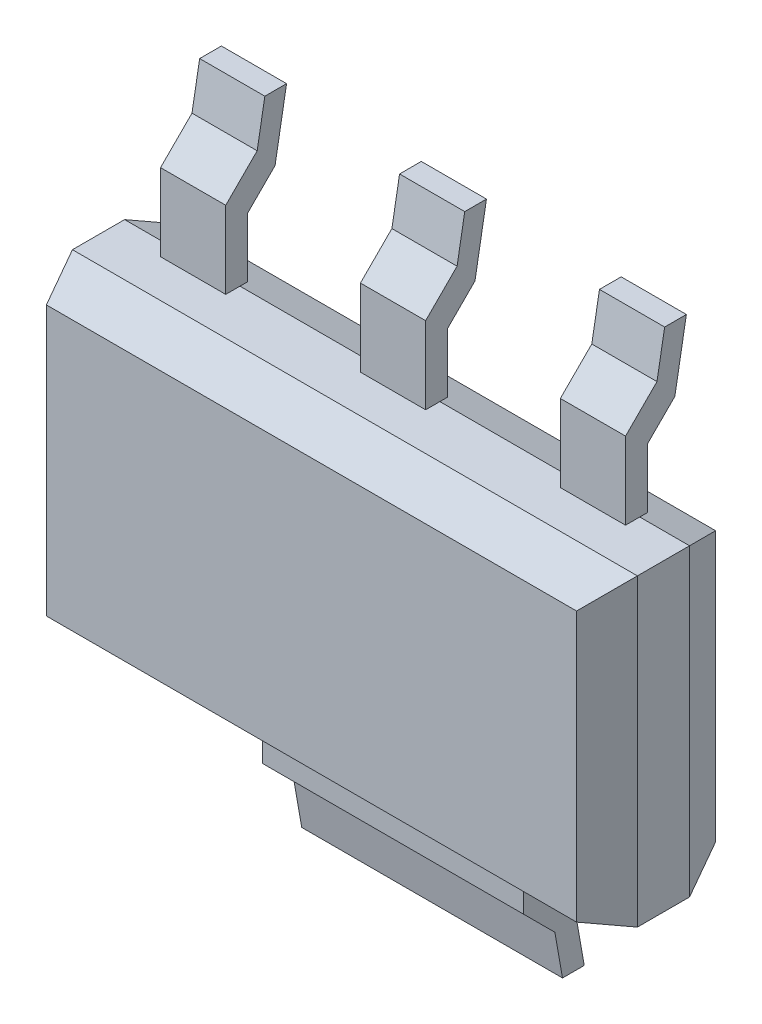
ISO-10303-21;
HEADER;
FILE_DESCRIPTION(('STEP AP214'),'2;1');
FILE_NAME('part.step','',(''),(''),'','','');
FILE_SCHEMA(('AUTOMOTIVE_DESIGN { 1 0 10303 214 1 1 1 1 }'));
ENDSEC;
DATA;
#1=APPLICATION_CONTEXT('core data for automotive mechanical design processes');
#2=APPLICATION_PROTOCOL_DEFINITION('international standard','automotive_design',2000,#1);
#3=PRODUCT_CONTEXT('',#1,'mechanical');
#4=PRODUCT('Part','Part','',(#3));
#5=PRODUCT_RELATED_PRODUCT_CATEGORY('part','',(#4));
#6=PRODUCT_DEFINITION_FORMATION('','',#4);
#7=PRODUCT_DEFINITION_CONTEXT('part definition',#1,'design');
#8=PRODUCT_DEFINITION('design','',#6,#7);
#9=PRODUCT_DEFINITION_SHAPE('','',#8);
#10=(LENGTH_UNIT() NAMED_UNIT(*) SI_UNIT(.MILLI.,.METRE.));
#11=(NAMED_UNIT(*) PLANE_ANGLE_UNIT() SI_UNIT($,.RADIAN.));
#12=(NAMED_UNIT(*) SI_UNIT($,.STERADIAN.) SOLID_ANGLE_UNIT());
#13=UNCERTAINTY_MEASURE_WITH_UNIT(LENGTH_MEASURE(1.E-05),#10,'distance_accuracy_value','');
#14=(GEOMETRIC_REPRESENTATION_CONTEXT(3) GLOBAL_UNCERTAINTY_ASSIGNED_CONTEXT((#13)) GLOBAL_UNIT_ASSIGNED_CONTEXT((#10,
#11,#12)) REPRESENTATION_CONTEXT('',''));
#15=CARTESIAN_POINT('',(0.,0.,0.));
#16=DIRECTION('',(0.,0.,1.));
#17=DIRECTION('',(1.,0.,0.));
#18=AXIS2_PLACEMENT_3D('',#15,#16,#17);
#19=CARTESIAN_POINT('',(-1.788503,1.787631,1.60000000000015));
#20=DIRECTION('',(0.,0.,-0.999999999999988));
#21=DIRECTION('',(-1.,0.,0.));
#22=AXIS2_PLACEMENT_3D('',#19,#20,#21);
#23=PLANE('',#22);
#24=DIRECTION('',(1.,0.,0.));
#25=VECTOR('',#24,1.);
#26=CARTESIAN_POINT('',(4.71149699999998,5.0876309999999,1.60000000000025));
#27=LINE('',#26,#25);
#28=CARTESIAN_POINT('',(-1.58850300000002,5.08763099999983,1.60000000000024));
#29=VERTEX_POINT('',#28);
#30=CARTESIAN_POINT('',(4.511497,5.0876309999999,1.60000000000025));
#31=VERTEX_POINT('',#30);
#32=EDGE_CURVE('P0_E92',#29,#31,#27,.T.);
#33=ORIENTED_EDGE('',*,*,#32,.F.);
#34=DIRECTION('',(0.,0.999999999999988,0.));
#35=VECTOR('',#34,1.);
#36=CARTESIAN_POINT('',(-1.58850300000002,5.28763099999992,1.60000000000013));
#37=LINE('',#36,#35);
#38=CARTESIAN_POINT('',(-1.58850299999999,1.98763100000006,1.60000000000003));
#39=VERTEX_POINT('',#38);
#40=EDGE_CURVE('P0_E79',#39,#29,#37,.T.);
#41=ORIENTED_EDGE('',*,*,#40,.F.);
#42=DIRECTION('',(1.,0.,0.));
#43=VECTOR('',#42,1.);
#44=CARTESIAN_POINT('',(-1.788503,1.98763099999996,1.60000000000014));
#45=LINE('',#44,#43);
#46=CARTESIAN_POINT('',(4.511497,1.98763100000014,1.6000000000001));
#47=VERTEX_POINT('',#46);
#48=EDGE_CURVE('P0_E19',#47,#39,#45,.F.);
#49=ORIENTED_EDGE('',*,*,#48,.F.);
#50=DIRECTION('',(0.,0.999999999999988,0.));
#51=VECTOR('',#50,1.);
#52=CARTESIAN_POINT('',(4.511497,1.78763100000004,1.60000000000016));
#53=LINE('',#52,#51);
#54=EDGE_CURVE('P0_E107',#31,#47,#53,.F.);
#55=ORIENTED_EDGE('',*,*,#54,.F.);
#56=EDGE_LOOP('',(#33,#41,#49,#55));
#57=FACE_BOUND('',#56,.T.);
#58=ADVANCED_FACE('P0_F16',(#57),#23,.F.);
#59=CARTESIAN_POINT('',(-1.788503,1.88763100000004,1.34999999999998));
#60=DIRECTION('',(0.,-0.928476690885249,0.371390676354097));
#61=DIRECTION('',(0.,-0.371390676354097,-0.928476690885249));
#62=AXIS2_PLACEMENT_3D('',#59,#60,#61);
#63=PLANE('',#62);
#64=DIRECTION('',(0.348155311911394,-0.348155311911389,-0.870388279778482));
#65=VECTOR('',#64,1.);
#66=CARTESIAN_POINT('',(4.511497,1.98763100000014,1.6000000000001));
#67=LINE('',#66,#65);
#68=CARTESIAN_POINT('',(4.71149700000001,1.78763100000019,1.10000000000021));
#69=VERTEX_POINT('',#68);
#70=EDGE_CURVE('P0_E88',#47,#69,#67,.T.);
#71=ORIENTED_EDGE('',*,*,#70,.F.);
#72=ORIENTED_EDGE('',*,*,#48,.T.);
#73=DIRECTION('',(0.348155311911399,0.348155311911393,0.870388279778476));
#74=VECTOR('',#73,1.);
#75=CARTESIAN_POINT('',(-1.788503,1.78763099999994,1.10000000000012));
#76=LINE('',#75,#74);
#77=CARTESIAN_POINT('',(-1.788503,1.78763099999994,1.10000000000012));
#78=VERTEX_POINT('',#77);
#79=EDGE_CURVE('P0_E85',#78,#39,#76,.T.);
#80=ORIENTED_EDGE('',*,*,#79,.F.);
#81=DIRECTION('',(1.,0.,0.));
#82=VECTOR('',#81,1.);
#83=CARTESIAN_POINT('',(-1.788503,1.78763099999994,1.10000000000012));
#84=LINE('',#83,#82);
#85=EDGE_CURVE('P0_E109',#78,#69,#84,.T.);
#86=ORIENTED_EDGE('',*,*,#85,.T.);
#87=EDGE_LOOP('',(#71,#72,#80,#86));
#88=FACE_BOUND('',#87,.T.);
#89=ADVANCED_FACE('P0_F84',(#88),#63,.T.);
#90=CARTESIAN_POINT('',(-1.68850300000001,5.28763099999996,1.35000000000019));
#91=DIRECTION('',(-0.928476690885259,0.,0.371390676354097));
#92=DIRECTION('',(0.371390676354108,0.,0.92847669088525));
#93=AXIS2_PLACEMENT_3D('',#90,#91,#92);
#94=PLANE('',#93);
#95=ORIENTED_EDGE('',*,*,#79,.T.);
#96=ORIENTED_EDGE('',*,*,#40,.T.);
#97=DIRECTION('',(0.348155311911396,-0.34815531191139,0.870388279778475));
#98=VECTOR('',#97,1.);
#99=CARTESIAN_POINT('',(-1.788503,5.28763099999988,1.10000000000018));
#100=LINE('',#99,#98);
#101=CARTESIAN_POINT('',(-1.788503,5.28763099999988,1.10000000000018));
#102=VERTEX_POINT('',#101);
#103=EDGE_CURVE('P0_E94',#102,#29,#100,.T.);
#104=ORIENTED_EDGE('',*,*,#103,.F.);
#105=DIRECTION('',(0.,0.999999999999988,0.));
#106=VECTOR('',#105,1.);
#107=CARTESIAN_POINT('',(-1.788503,5.28763099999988,1.10000000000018));
#108=LINE('',#107,#106);
#109=EDGE_CURVE('P0_E98',#102,#78,#108,.F.);
#110=ORIENTED_EDGE('',*,*,#109,.T.);
#111=EDGE_LOOP('',(#95,#96,#104,#110));
#112=FACE_BOUND('',#111,.T.);
#113=ADVANCED_FACE('P0_F96',(#112),#94,.T.);
#114=CARTESIAN_POINT('',(4.71149699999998,5.18763100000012,1.35000000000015));
#115=DIRECTION('',(0.,0.928476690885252,0.371390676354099));
#116=DIRECTION('',(0.,-0.371390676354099,0.928476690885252));
#117=AXIS2_PLACEMENT_3D('',#114,#115,#116);
#118=PLANE('',#117);
#119=ORIENTED_EDGE('',*,*,#103,.T.);
#120=ORIENTED_EDGE('',*,*,#32,.T.);
#121=DIRECTION('',(-0.348155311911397,-0.348155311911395,0.870388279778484));
#122=VECTOR('',#121,1.);
#123=CARTESIAN_POINT('',(4.71149700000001,5.28763100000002,1.10000000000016));
#124=LINE('',#123,#122);
#125=CARTESIAN_POINT('',(4.71149700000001,5.28763100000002,1.10000000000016));
#126=VERTEX_POINT('',#125);
#127=EDGE_CURVE('P0_E104',#126,#31,#124,.T.);
#128=ORIENTED_EDGE('',*,*,#127,.F.);
#129=DIRECTION('',(1.,0.,0.));
#130=VECTOR('',#129,1.);
#131=CARTESIAN_POINT('',(4.71149699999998,5.28763100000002,1.10000000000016));
#132=LINE('',#131,#130);
#133=EDGE_CURVE('P0_E114',#126,#102,#132,.F.);
#134=ORIENTED_EDGE('',*,*,#133,.T.);
#135=EDGE_LOOP('',(#119,#120,#128,#134));
#136=FACE_BOUND('',#135,.T.);
#137=ADVANCED_FACE('P0_F184',(#136),#118,.T.);
#138=CARTESIAN_POINT('',(4.61149699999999,1.78763100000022,1.35000000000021));
#139=DIRECTION('',(0.928476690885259,0.,0.371390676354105));
#140=DIRECTION('',(0.371390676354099,0.,-0.928476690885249));
#141=AXIS2_PLACEMENT_3D('',#138,#139,#140);
#142=PLANE('',#141);
#143=ORIENTED_EDGE('',*,*,#127,.T.);
#144=ORIENTED_EDGE('',*,*,#54,.T.);
#145=ORIENTED_EDGE('',*,*,#70,.T.);
#146=DIRECTION('',(0.,0.999999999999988,0.));
#147=VECTOR('',#146,1.);
#148=CARTESIAN_POINT('',(4.71149700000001,1.78763100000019,1.10000000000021));
#149=LINE('',#148,#147);
#150=EDGE_CURVE('P0_E122',#69,#126,#149,.T.);
#151=ORIENTED_EDGE('',*,*,#150,.T.);
#152=EDGE_LOOP('',(#143,#144,#145,#151));
#153=FACE_BOUND('',#152,.T.);
#154=ADVANCED_FACE('P0_F177',(#153),#142,.T.);
#155=CARTESIAN_POINT('',(-1.788503,1.78763100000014,1.94289029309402E-13));
#156=DIRECTION('',(0.,0.999999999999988,0.));
#157=DIRECTION('',(0.,0.,0.999999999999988));
#158=AXIS2_PLACEMENT_3D('',#155,#156,#157);
#159=PLANE('',#158);
#160=DIRECTION('',(0.,0.,0.999999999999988));
#161=VECTOR('',#160,1.);
#162=CARTESIAN_POINT('',(4.71149700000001,1.78763100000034,2.35922392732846E-13));
#163=LINE('',#162,#161);
#164=CARTESIAN_POINT('',(4.71149700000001,1.78763100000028,0.500000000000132));
#165=VERTEX_POINT('',#164);
#166=EDGE_CURVE('P0_E119',#165,#69,#163,.T.);
#167=ORIENTED_EDGE('',*,*,#166,.T.);
#168=ORIENTED_EDGE('',*,*,#85,.F.);
#169=DIRECTION('',(0.,0.,-0.999999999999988));
#170=VECTOR('',#169,1.);
#171=CARTESIAN_POINT('',(-1.788503,1.78763100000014,1.94289029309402E-13));
#172=LINE('',#171,#170);
#173=CARTESIAN_POINT('',(-1.788503,1.7876310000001,0.500000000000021));
#174=VERTEX_POINT('',#173);
#175=EDGE_CURVE('P0_E112',#78,#174,#172,.T.);
#176=ORIENTED_EDGE('',*,*,#175,.T.);
#177=DIRECTION('',(1.,0.,0.));
#178=VECTOR('',#177,1.);
#179=CARTESIAN_POINT('',(-1.788503,1.7876310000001,0.500000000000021));
#180=LINE('',#179,#178);
#181=EDGE_CURVE('P0_E127',#174,#165,#180,.T.);
#182=ORIENTED_EDGE('',*,*,#181,.T.);
#183=EDGE_LOOP('',(#167,#168,#176,#182));
#184=FACE_BOUND('',#183,.T.);
#185=ADVANCED_FACE('P0_F172',(#184),#159,.F.);
#186=CARTESIAN_POINT('',(-1.788503,5.28763100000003,1.28369537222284E-13));
#187=DIRECTION('',(1.,0.,0.));
#188=DIRECTION('',(0.,0.,-0.999999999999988));
#189=AXIS2_PLACEMENT_3D('',#186,#187,#188);
#190=PLANE('',#189);
#191=ORIENTED_EDGE('',*,*,#175,.F.);
#192=ORIENTED_EDGE('',*,*,#109,.F.);
#193=DIRECTION('',(0.,0.,-0.999999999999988));
#194=VECTOR('',#193,1.);
#195=CARTESIAN_POINT('',(-1.788503,5.28763100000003,1.28369537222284E-13));
#196=LINE('',#195,#194);
#197=CARTESIAN_POINT('',(-1.788503,5.28763100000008,0.500000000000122));
#198=VERTEX_POINT('',#197);
#199=EDGE_CURVE('P0_E117',#102,#198,#196,.T.);
#200=ORIENTED_EDGE('',*,*,#199,.T.);
#201=DIRECTION('',(0.,0.999999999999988,0.));
#202=VECTOR('',#201,1.);
#203=CARTESIAN_POINT('',(-1.788503,5.28763100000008,0.500000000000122));
#204=LINE('',#203,#202);
#205=EDGE_CURVE('P0_E129',#198,#174,#204,.F.);
#206=ORIENTED_EDGE('',*,*,#205,.T.);
#207=EDGE_LOOP('',(#191,#192,#200,#206));
#208=FACE_BOUND('',#207,.T.);
#209=ADVANCED_FACE('P0_F165',(#208),#190,.F.);
#210=CARTESIAN_POINT('',(4.71149699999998,5.28763100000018,1.66533453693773E-13));
#211=DIRECTION('',(0.,-0.999999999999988,0.));
#212=DIRECTION('',(0.,0.,-0.999999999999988));
#213=AXIS2_PLACEMENT_3D('',#210,#211,#212);
#214=PLANE('',#213);
#215=ORIENTED_EDGE('',*,*,#199,.F.);
#216=ORIENTED_EDGE('',*,*,#133,.F.);
#217=DIRECTION('',(0.,0.,0.999999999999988));
#218=VECTOR('',#217,1.);
#219=CARTESIAN_POINT('',(4.71149699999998,5.28763100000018,1.66533453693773E-13));
#220=LINE('',#219,#218);
#221=CARTESIAN_POINT('',(4.71149700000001,5.28763100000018,0.500000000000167));
#222=VERTEX_POINT('',#221);
#223=EDGE_CURVE('P0_E125',#126,#222,#220,.F.);
#224=ORIENTED_EDGE('',*,*,#223,.T.);
#225=DIRECTION('',(1.,0.,0.));
#226=VECTOR('',#225,1.);
#227=CARTESIAN_POINT('',(4.71149699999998,5.28763100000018,0.500000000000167));
#228=LINE('',#227,#226);
#229=EDGE_CURVE('P0_E134',#222,#198,#228,.F.);
#230=ORIENTED_EDGE('',*,*,#229,.T.);
#231=EDGE_LOOP('',(#215,#216,#224,#230));
#232=FACE_BOUND('',#231,.T.);
#233=ADVANCED_FACE('P0_F182',(#232),#214,.F.);
#234=CARTESIAN_POINT('',(4.71149700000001,1.78763100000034,2.35922392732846E-13));
#235=DIRECTION('',(-1.,0.,0.));
#236=DIRECTION('',(0.,0.,0.999999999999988));
#237=AXIS2_PLACEMENT_3D('',#234,#235,#236);
#238=PLANE('',#237);
#239=ORIENTED_EDGE('',*,*,#223,.F.);
#240=ORIENTED_EDGE('',*,*,#150,.F.);
#241=ORIENTED_EDGE('',*,*,#166,.F.);
#242=DIRECTION('',(0.,0.999999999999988,0.));
#243=VECTOR('',#242,1.);
#244=CARTESIAN_POINT('',(4.71149700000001,1.78763100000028,0.500000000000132));
#245=LINE('',#244,#243);
#246=EDGE_CURVE('P0_E142',#165,#222,#245,.T.);
#247=ORIENTED_EDGE('',*,*,#246,.T.);
#248=EDGE_LOOP('',(#239,#240,#241,#247));
#249=FACE_BOUND('',#248,.T.);
#250=ADVANCED_FACE('P0_F180',(#249),#238,.F.);
#251=CARTESIAN_POINT('',(-1.788503,1.88763099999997,0.249999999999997));
#252=DIRECTION('',(0.,0.928476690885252,0.371390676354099));
#253=DIRECTION('',(0.,-0.371390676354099,0.928476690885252));
#254=AXIS2_PLACEMENT_3D('',#251,#252,#253);
#255=PLANE('',#254);
#256=DIRECTION('',(0.348155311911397,-0.348155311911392,0.870388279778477));
#257=VECTOR('',#256,1.);
#258=CARTESIAN_POINT('',(4.511497,1.98763100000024,1.76941794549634E-13));
#259=LINE('',#258,#257);
#260=CARTESIAN_POINT('',(4.511497,1.98763100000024,1.76941794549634E-13));
#261=VERTEX_POINT('',#260);
#262=EDGE_CURVE('P0_E139',#261,#165,#259,.T.);
#263=ORIENTED_EDGE('',*,*,#262,.T.);
#264=ORIENTED_EDGE('',*,*,#181,.F.);
#265=DIRECTION('',(0.348155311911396,0.348155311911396,-0.870388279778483));
#266=VECTOR('',#265,1.);
#267=CARTESIAN_POINT('',(-1.788503,1.7876310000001,0.500000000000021));
#268=LINE('',#267,#266);
#269=CARTESIAN_POINT('',(-1.58850299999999,1.98763100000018,1.14491749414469E-13));
#270=VERTEX_POINT('',#269);
#271=EDGE_CURVE('P0_E132',#174,#270,#268,.T.);
#272=ORIENTED_EDGE('',*,*,#271,.T.);
#273=DIRECTION('',(-1.,0.,0.));
#274=VECTOR('',#273,1.);
#275=CARTESIAN_POINT('',(-1.788503,1.98763100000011,1.21430643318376E-13));
#276=LINE('',#275,#274);
#277=EDGE_CURVE('P0_E146',#261,#270,#276,.T.);
#278=ORIENTED_EDGE('',*,*,#277,.F.);
#279=EDGE_LOOP('',(#263,#264,#272,#278));
#280=FACE_BOUND('',#279,.T.);
#281=ADVANCED_FACE('P0_F168',(#280),#255,.F.);
#282=CARTESIAN_POINT('',(-1.68850300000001,5.28763099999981,0.25000000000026));
#283=DIRECTION('',(0.928476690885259,0.,0.371390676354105));
#284=DIRECTION('',(0.371390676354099,0.,-0.928476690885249));
#285=AXIS2_PLACEMENT_3D('',#282,#283,#284);
#286=PLANE('',#285);
#287=ORIENTED_EDGE('',*,*,#271,.F.);
#288=ORIENTED_EDGE('',*,*,#205,.F.);
#289=DIRECTION('',(0.348155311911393,-0.348155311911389,-0.870388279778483));
#290=VECTOR('',#289,1.);
#291=CARTESIAN_POINT('',(-1.788503,5.28763100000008,0.500000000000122));
#292=LINE('',#291,#290);
#293=CARTESIAN_POINT('',(-1.58850299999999,5.08763099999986,1.35308431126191E-13));
#294=VERTEX_POINT('',#293);
#295=EDGE_CURVE('P0_E137',#198,#294,#292,.T.);
#296=ORIENTED_EDGE('',*,*,#295,.T.);
#297=DIRECTION('',(0.,0.999999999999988,0.));
#298=VECTOR('',#297,1.);
#299=CARTESIAN_POINT('',(-1.58850299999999,1.78763100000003,2.22044604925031E-13));
#300=LINE('',#299,#298);
#301=EDGE_CURVE('P0_E149',#270,#294,#300,.T.);
#302=ORIENTED_EDGE('',*,*,#301,.F.);
#303=EDGE_LOOP('',(#287,#288,#296,#302));
#304=FACE_BOUND('',#303,.T.);
#305=ADVANCED_FACE('P0_F161',(#304),#286,.F.);
#306=CARTESIAN_POINT('',(4.71149699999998,5.18763099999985,0.250000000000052));
#307=DIRECTION('',(0.,-0.928476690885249,0.371390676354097));
#308=DIRECTION('',(0.,-0.371390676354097,-0.928476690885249));
#309=AXIS2_PLACEMENT_3D('',#306,#307,#308);
#310=PLANE('',#309);
#311=ORIENTED_EDGE('',*,*,#295,.F.);
#312=ORIENTED_EDGE('',*,*,#229,.F.);
#313=DIRECTION('',(-0.3481553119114,-0.348155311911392,-0.870388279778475));
#314=VECTOR('',#313,1.);
#315=CARTESIAN_POINT('',(4.71149700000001,5.28763100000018,0.500000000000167));
#316=LINE('',#315,#314);
#317=CARTESIAN_POINT('',(4.511497,5.08763100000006,1.66533453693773E-13));
#318=VERTEX_POINT('',#317);
#319=EDGE_CURVE('P0_E34',#222,#318,#316,.T.);
#320=ORIENTED_EDGE('',*,*,#319,.T.);
#321=DIRECTION('',(-1.,0.,0.));
#322=VECTOR('',#321,1.);
#323=CARTESIAN_POINT('',(-1.788503,5.08763099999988,1.52655665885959E-13));
#324=LINE('',#323,#322);
#325=EDGE_CURVE('P0_E25',#294,#318,#324,.F.);
#326=ORIENTED_EDGE('',*,*,#325,.F.);
#327=EDGE_LOOP('',(#311,#312,#320,#326));
#328=FACE_BOUND('',#327,.T.);
#329=ADVANCED_FACE('P0_F157',(#328),#310,.F.);
#330=CARTESIAN_POINT('',(4.61149699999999,1.78763100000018,0.250000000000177));
#331=DIRECTION('',(-0.928476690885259,0.,0.371390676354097));
#332=DIRECTION('',(0.371390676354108,0.,0.92847669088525));
#333=AXIS2_PLACEMENT_3D('',#330,#331,#332);
#334=PLANE('',#333);
#335=ORIENTED_EDGE('',*,*,#319,.F.);
#336=ORIENTED_EDGE('',*,*,#246,.F.);
#337=ORIENTED_EDGE('',*,*,#262,.F.);
#338=DIRECTION('',(0.,0.999999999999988,0.));
#339=VECTOR('',#338,1.);
#340=CARTESIAN_POINT('',(4.511497,1.78763100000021,2.74086309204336E-13));
#341=LINE('',#340,#339);
#342=EDGE_CURVE('P0_E11',#318,#261,#341,.F.);
#343=ORIENTED_EDGE('',*,*,#342,.F.);
#344=EDGE_LOOP('',(#335,#336,#337,#343));
#345=FACE_BOUND('',#344,.T.);
#346=ADVANCED_FACE('P0_F195',(#345),#334,.F.);
#347=CARTESIAN_POINT('',(-1.788503,1.78763100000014,1.94289029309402E-13));
#348=DIRECTION('',(0.,0.,-0.999999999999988));
#349=DIRECTION('',(-1.,0.,0.));
#350=AXIS2_PLACEMENT_3D('',#347,#348,#349);
#351=PLANE('',#350);
#352=ORIENTED_EDGE('',*,*,#325,.T.);
#353=ORIENTED_EDGE('',*,*,#342,.T.);
#354=ORIENTED_EDGE('',*,*,#277,.T.);
#355=ORIENTED_EDGE('',*,*,#301,.T.);
#356=EDGE_LOOP('',(#352,#353,#354,#355));
#357=FACE_BOUND('',#356,.T.);
#358=ADVANCED_FACE('P0_F154',(#357),#351,.T.);
#359=CLOSED_SHELL('',(#58,#89,#113,#137,#154,#185,#209,#233,#250,#281,#305,#329,#346,#358));
#360=MANIFOLD_SOLID_BREP('P0_B1',#359);
#361=CARTESIAN_POINT('',(1.87499999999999,6.32399999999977,0.132245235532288));
#362=DIRECTION('',(0.,-0.17364817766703,-0.98480775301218));
#363=DIRECTION('',(0.,0.98480775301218,-0.17364817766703));
#364=AXIS2_PLACEMENT_3D('',#361,#362,#363);
#365=PLANE('',#364);
#366=DIRECTION('',(1.,0.,0.));
#367=VECTOR('',#366,1.);
#368=CARTESIAN_POINT('',(1.87499999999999,7.074,0.));
#369=LINE('',#368,#367);
#370=CARTESIAN_POINT('',(1.87499999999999,7.07399999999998,3.95516952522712E-13));
#371=VERTEX_POINT('',#370);
#372=CARTESIAN_POINT('',(1.12499999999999,7.07400000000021,4.78783679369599E-13));
#373=VERTEX_POINT('',#372);
#374=EDGE_CURVE('P1_E109',#371,#373,#369,.F.);
#375=ORIENTED_EDGE('',*,*,#374,.F.);
#376=DIRECTION('',(0.,-0.98480775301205,0.173648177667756));
#377=VECTOR('',#376,1.);
#378=CARTESIAN_POINT('',(1.87499999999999,7.074,0.));
#379=LINE('',#378,#377);
#380=CARTESIAN_POINT('',(1.87499999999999,6.32399999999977,0.132245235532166));
#381=VERTEX_POINT('',#380);
#382=EDGE_CURVE('P1_E84',#371,#381,#379,.T.);
#383=ORIENTED_EDGE('',*,*,#382,.T.);
#384=DIRECTION('',(1.,0.,0.));
#385=VECTOR('',#384,1.);
#386=CARTESIAN_POINT('',(1.87499999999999,6.32399999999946,0.132245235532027));
#387=LINE('',#386,#385);
#388=CARTESIAN_POINT('',(1.12499999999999,6.32399999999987,0.132245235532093));
#389=VERTEX_POINT('',#388);
#390=EDGE_CURVE('P1_E19',#389,#381,#387,.T.);
#391=ORIENTED_EDGE('',*,*,#390,.F.);
#392=DIRECTION('',(0.,-0.98480775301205,0.173648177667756));
#393=VECTOR('',#392,1.);
#394=CARTESIAN_POINT('',(1.12499999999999,7.07400000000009,1.52655665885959E-13));
#395=LINE('',#394,#393);
#396=EDGE_CURVE('P1_E79',#373,#389,#395,.T.);
#397=ORIENTED_EDGE('',*,*,#396,.F.);
#398=EDGE_LOOP('',(#375,#383,#391,#397));
#399=FACE_BOUND('',#398,.T.);
#400=ADVANCED_FACE('P1_F16',(#399),#365,.T.);
#401=CARTESIAN_POINT('',(1.87499999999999,6.00624523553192,0.450000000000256));
#402=DIRECTION('',(0.,-0.707106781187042,-0.707106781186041));
#403=DIRECTION('',(0.,0.707106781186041,-0.707106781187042));
#404=AXIS2_PLACEMENT_3D('',#401,#402,#403);
#405=PLANE('',#404);
#406=ORIENTED_EDGE('',*,*,#390,.T.);
#407=DIRECTION('',(0.,-0.70710678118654,0.707106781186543));
#408=VECTOR('',#407,1.);
#409=CARTESIAN_POINT('',(1.87499999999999,6.32399999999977,0.132245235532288));
#410=LINE('',#409,#408);
#411=CARTESIAN_POINT('',(1.87499999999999,6.00624523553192,0.450000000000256));
#412=VERTEX_POINT('',#411);
#413=EDGE_CURVE('P1_E118',#381,#412,#410,.T.);
#414=ORIENTED_EDGE('',*,*,#413,.T.);
#415=DIRECTION('',(1.,0.,0.));
#416=VECTOR('',#415,1.);
#417=CARTESIAN_POINT('',(1.87499999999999,6.00624523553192,0.450000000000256));
#418=LINE('',#417,#416);
#419=CARTESIAN_POINT('',(1.12499999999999,6.00624523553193,0.450000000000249));
#420=VERTEX_POINT('',#419);
#421=EDGE_CURVE('P1_E87',#420,#412,#418,.T.);
#422=ORIENTED_EDGE('',*,*,#421,.F.);
#423=DIRECTION('',(0.,-0.70710678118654,0.707106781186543));
#424=VECTOR('',#423,1.);
#425=CARTESIAN_POINT('',(1.12499999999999,6.32399999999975,0.132245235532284));
#426=LINE('',#425,#424);
#427=EDGE_CURVE('P1_E89',#389,#420,#426,.T.);
#428=ORIENTED_EDGE('',*,*,#427,.F.);
#429=EDGE_LOOP('',(#406,#414,#422,#428));
#430=FACE_BOUND('',#429,.T.);
#431=ADVANCED_FACE('P1_F90',(#430),#405,.T.);
#432=CARTESIAN_POINT('',(1.87499999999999,5.32400000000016,0.45000000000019));
#433=DIRECTION('',(0.,0.,-0.99999999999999));
#434=DIRECTION('',(0.,0.99999999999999,0.));
#435=AXIS2_PLACEMENT_3D('',#432,#433,#434);
#436=PLANE('',#435);
#437=ORIENTED_EDGE('',*,*,#421,.T.);
#438=DIRECTION('',(0.,-0.99999999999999,0.));
#439=VECTOR('',#438,1.);
#440=CARTESIAN_POINT('',(1.87499999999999,7.07400000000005,0.450000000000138));
#441=LINE('',#440,#439);
#442=CARTESIAN_POINT('',(1.87499999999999,5.32400000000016,0.45000000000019));
#443=VERTEX_POINT('',#442);
#444=EDGE_CURVE('P1_E114',#412,#443,#441,.T.);
#445=ORIENTED_EDGE('',*,*,#444,.T.);
#446=DIRECTION('',(1.,0.,0.));
#447=VECTOR('',#446,1.);
#448=CARTESIAN_POINT('',(1.87499999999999,5.32400000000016,0.45000000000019));
#449=LINE('',#448,#447);
#450=CARTESIAN_POINT('',(1.12499999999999,5.32400000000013,0.449999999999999));
#451=VERTEX_POINT('',#450);
#452=EDGE_CURVE('P1_E126',#451,#443,#449,.T.);
#453=ORIENTED_EDGE('',*,*,#452,.F.);
#454=DIRECTION('',(0.,-0.99999999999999,0.));
#455=VECTOR('',#454,1.);
#456=CARTESIAN_POINT('',(1.12499999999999,7.07400000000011,0.450000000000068));
#457=LINE('',#456,#455);
#458=EDGE_CURVE('P1_E94',#420,#451,#457,.T.);
#459=ORIENTED_EDGE('',*,*,#458,.F.);
#460=EDGE_LOOP('',(#437,#445,#453,#459));
#461=FACE_BOUND('',#460,.T.);
#462=ADVANCED_FACE('P1_F112',(#461),#436,.T.);
#463=CARTESIAN_POINT('',(1.87499999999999,7.07400000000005,0.250000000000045));
#464=DIRECTION('',(0.,0.17364817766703,0.98480775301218));
#465=DIRECTION('',(0.,-0.98480775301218,0.17364817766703));
#466=AXIS2_PLACEMENT_3D('',#463,#464,#465);
#467=PLANE('',#466);
#468=DIRECTION('',(1.,0.,0.));
#469=VECTOR('',#468,1.);
#470=CARTESIAN_POINT('',(1.87499999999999,6.57400000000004,0.33816349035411));
#471=LINE('',#470,#469);
#472=CARTESIAN_POINT('',(1.87499999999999,6.57400000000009,0.33816349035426));
#473=VERTEX_POINT('',#472);
#474=CARTESIAN_POINT('',(1.12499999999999,6.57400000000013,0.33816349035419));
#475=VERTEX_POINT('',#474);
#476=EDGE_CURVE('P1_E101',#473,#475,#471,.F.);
#477=ORIENTED_EDGE('',*,*,#476,.F.);
#478=DIRECTION('',(0.,0.984807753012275,-0.173648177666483));
#479=VECTOR('',#478,1.);
#480=CARTESIAN_POINT('',(1.87499999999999,6.57400000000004,0.33816349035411));
#481=LINE('',#480,#479);
#482=CARTESIAN_POINT('',(1.87499999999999,7.07400000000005,0.250000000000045));
#483=VERTEX_POINT('',#482);
#484=EDGE_CURVE('P1_E152',#473,#483,#481,.T.);
#485=ORIENTED_EDGE('',*,*,#484,.T.);
#486=DIRECTION('',(1.,0.,0.));
#487=VECTOR('',#486,1.);
#488=CARTESIAN_POINT('',(1.87499999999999,7.07400000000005,0.250000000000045));
#489=LINE('',#488,#487);
#490=CARTESIAN_POINT('',(1.12499999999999,7.07400000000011,0.250000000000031));
#491=VERTEX_POINT('',#490);
#492=EDGE_CURVE('P1_E103',#491,#483,#489,.T.);
#493=ORIENTED_EDGE('',*,*,#492,.F.);
#494=DIRECTION('',(0.,0.984807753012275,-0.173648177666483));
#495=VECTOR('',#494,1.);
#496=CARTESIAN_POINT('',(1.12499999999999,6.57400000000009,0.338163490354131));
#497=LINE('',#496,#495);
#498=EDGE_CURVE('P1_E132',#475,#491,#497,.T.);
#499=ORIENTED_EDGE('',*,*,#498,.F.);
#500=EDGE_LOOP('',(#477,#485,#493,#499));
#501=FACE_BOUND('',#500,.T.);
#502=ADVANCED_FACE('P1_F160',(#501),#467,.T.);
#503=CARTESIAN_POINT('',(1.87499999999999,7.074,0.));
#504=DIRECTION('',(0.,0.99999999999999,0.));
#505=DIRECTION('',(0.,0.,0.99999999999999));
#506=AXIS2_PLACEMENT_3D('',#503,#504,#505);
#507=PLANE('',#506);
#508=ORIENTED_EDGE('',*,*,#492,.T.);
#509=DIRECTION('',(0.,0.,0.99999999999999));
#510=VECTOR('',#509,1.);
#511=CARTESIAN_POINT('',(1.87499999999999,7.074,0.));
#512=LINE('',#511,#510);
#513=EDGE_CURVE('P1_E147',#483,#371,#512,.F.);
#514=ORIENTED_EDGE('',*,*,#513,.T.);
#515=ORIENTED_EDGE('',*,*,#374,.T.);
#516=DIRECTION('',(0.,0.,0.99999999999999));
#517=VECTOR('',#516,1.);
#518=CARTESIAN_POINT('',(1.12499999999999,7.07400000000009,1.52655665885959E-13));
#519=LINE('',#518,#517);
#520=EDGE_CURVE('P1_E100',#491,#373,#519,.F.);
#521=ORIENTED_EDGE('',*,*,#520,.F.);
#522=EDGE_LOOP('',(#508,#514,#515,#521));
#523=FACE_BOUND('',#522,.T.);
#524=ADVANCED_FACE('P1_F162',(#523),#507,.T.);
#525=CARTESIAN_POINT('',(1.87499999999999,6.57400000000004,0.33816349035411));
#526=DIRECTION('',(0.,0.707106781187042,0.707106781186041));
#527=DIRECTION('',(0.,-0.707106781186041,0.707106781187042));
#528=AXIS2_PLACEMENT_3D('',#525,#526,#527);
#529=PLANE('',#528);
#530=DIRECTION('',(1.,0.,0.));
#531=VECTOR('',#530,1.);
#532=CARTESIAN_POINT('',(1.87499999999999,6.21216349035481,0.700000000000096));
#533=LINE('',#532,#531);
#534=CARTESIAN_POINT('',(1.87499999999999,6.21216349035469,0.700000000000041));
#535=VERTEX_POINT('',#534);
#536=CARTESIAN_POINT('',(1.12499999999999,6.21216349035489,0.700000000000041));
#537=VERTEX_POINT('',#536);
#538=EDGE_CURVE('P1_E145',#535,#537,#533,.F.);
#539=ORIENTED_EDGE('',*,*,#538,.F.);
#540=DIRECTION('',(0.,0.707106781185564,-0.707106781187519));
#541=VECTOR('',#540,1.);
#542=CARTESIAN_POINT('',(1.87499999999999,6.21216349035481,0.700000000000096));
#543=LINE('',#542,#541);
#544=EDGE_CURVE('P1_E120',#535,#473,#543,.T.);
#545=ORIENTED_EDGE('',*,*,#544,.T.);
#546=ORIENTED_EDGE('',*,*,#476,.T.);
#547=DIRECTION('',(0.,0.707106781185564,-0.707106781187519));
#548=VECTOR('',#547,1.);
#549=CARTESIAN_POINT('',(1.12499999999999,6.21216349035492,0.700000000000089));
#550=LINE('',#549,#548);
#551=EDGE_CURVE('P1_E134',#537,#475,#550,.T.);
#552=ORIENTED_EDGE('',*,*,#551,.F.);
#553=EDGE_LOOP('',(#539,#545,#546,#552));
#554=FACE_BOUND('',#553,.T.);
#555=ADVANCED_FACE('P1_F156',(#554),#529,.T.);
#556=CARTESIAN_POINT('',(1.12499999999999,7.07400000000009,1.52655665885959E-13));
#557=DIRECTION('',(-1.,0.,0.));
#558=DIRECTION('',(0.,-0.99999999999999,0.));
#559=AXIS2_PLACEMENT_3D('',#556,#557,#558);
#560=PLANE('',#559);
#561=ORIENTED_EDGE('',*,*,#498,.T.);
#562=ORIENTED_EDGE('',*,*,#520,.T.);
#563=ORIENTED_EDGE('',*,*,#396,.T.);
#564=ORIENTED_EDGE('',*,*,#427,.T.);
#565=ORIENTED_EDGE('',*,*,#458,.T.);
#566=DIRECTION('',(0.,0.,-0.99999999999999));
#567=VECTOR('',#566,1.);
#568=CARTESIAN_POINT('',(1.12499999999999,5.32400000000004,0.70000000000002));
#569=LINE('',#568,#567);
#570=CARTESIAN_POINT('',(1.12499999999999,5.32400000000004,0.70000000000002));
#571=VERTEX_POINT('',#570);
#572=EDGE_CURVE('P1_E128',#571,#451,#569,.T.);
#573=ORIENTED_EDGE('',*,*,#572,.F.);
#574=DIRECTION('',(0.,-0.99999999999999,0.));
#575=VECTOR('',#574,1.);
#576=CARTESIAN_POINT('',(1.12499999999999,6.21216349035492,0.700000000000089));
#577=LINE('',#576,#575);
#578=EDGE_CURVE('P1_E141',#537,#571,#577,.T.);
#579=ORIENTED_EDGE('',*,*,#578,.F.);
#580=ORIENTED_EDGE('',*,*,#551,.T.);
#581=EDGE_LOOP('',(#561,#562,#563,#564,#565,#573,#579,#580));
#582=FACE_BOUND('',#581,.T.);
#583=ADVANCED_FACE('P1_F98',(#582),#560,.T.);
#584=CARTESIAN_POINT('',(1.87499999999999,5.32400000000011,0.7000000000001));
#585=DIRECTION('',(0.,-0.99999999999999,0.));
#586=DIRECTION('',(0.,0.,-0.99999999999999));
#587=AXIS2_PLACEMENT_3D('',#584,#585,#586);
#588=PLANE('',#587);
#589=ORIENTED_EDGE('',*,*,#452,.T.);
#590=DIRECTION('',(0.,0.,0.99999999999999));
#591=VECTOR('',#590,1.);
#592=CARTESIAN_POINT('',(1.87499999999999,5.32399999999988,1.31838984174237E-13));
#593=LINE('',#592,#591);
#594=CARTESIAN_POINT('',(1.87499999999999,5.32400000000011,0.7000000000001));
#595=VERTEX_POINT('',#594);
#596=EDGE_CURVE('P1_E34',#443,#595,#593,.T.);
#597=ORIENTED_EDGE('',*,*,#596,.T.);
#598=DIRECTION('',(1.,0.,0.));
#599=VECTOR('',#598,1.);
#600=CARTESIAN_POINT('',(1.87499999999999,5.32400000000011,0.7000000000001));
#601=LINE('',#600,#599);
#602=EDGE_CURVE('P1_E25',#571,#595,#601,.T.);
#603=ORIENTED_EDGE('',*,*,#602,.F.);
#604=ORIENTED_EDGE('',*,*,#572,.T.);
#605=EDGE_LOOP('',(#589,#597,#603,#604));
#606=FACE_BOUND('',#605,.T.);
#607=ADVANCED_FACE('P1_F137',(#606),#588,.T.);
#608=CARTESIAN_POINT('',(1.87499999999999,7.074,0.));
#609=DIRECTION('',(-1.,0.,0.));
#610=DIRECTION('',(0.,-0.99999999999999,0.));
#611=AXIS2_PLACEMENT_3D('',#608,#609,#610);
#612=PLANE('',#611);
#613=ORIENTED_EDGE('',*,*,#484,.F.);
#614=ORIENTED_EDGE('',*,*,#544,.F.);
#615=DIRECTION('',(0.,-0.99999999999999,0.));
#616=VECTOR('',#615,1.);
#617=CARTESIAN_POINT('',(1.87499999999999,6.21216349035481,0.700000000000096));
#618=LINE('',#617,#616);
#619=EDGE_CURVE('P1_E11',#595,#535,#618,.F.);
#620=ORIENTED_EDGE('',*,*,#619,.F.);
#621=ORIENTED_EDGE('',*,*,#596,.F.);
#622=ORIENTED_EDGE('',*,*,#444,.F.);
#623=ORIENTED_EDGE('',*,*,#413,.F.);
#624=ORIENTED_EDGE('',*,*,#382,.F.);
#625=ORIENTED_EDGE('',*,*,#513,.F.);
#626=EDGE_LOOP('',(#613,#614,#620,#621,#622,#623,#624,#625));
#627=FACE_BOUND('',#626,.T.);
#628=ADVANCED_FACE('P1_F117',(#627),#612,.F.);
#629=CARTESIAN_POINT('',(1.87499999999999,6.21216349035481,0.700000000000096));
#630=DIRECTION('',(0.,0.,0.99999999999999));
#631=DIRECTION('',(0.,-0.99999999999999,0.));
#632=AXIS2_PLACEMENT_3D('',#629,#630,#631);
#633=PLANE('',#632);
#634=ORIENTED_EDGE('',*,*,#602,.T.);
#635=ORIENTED_EDGE('',*,*,#619,.T.);
#636=ORIENTED_EDGE('',*,*,#538,.T.);
#637=ORIENTED_EDGE('',*,*,#578,.T.);
#638=EDGE_LOOP('',(#634,#635,#636,#637));
#639=FACE_BOUND('',#638,.T.);
#640=ADVANCED_FACE('P1_F144',(#639),#633,.T.);
#641=CLOSED_SHELL('',(#400,#431,#462,#502,#524,#555,#583,#607,#628,#640));
#642=MANIFOLD_SOLID_BREP('P1_B1',#641);
#643=CARTESIAN_POINT('',(4.17500000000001,6.32399999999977,0.132245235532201));
#644=DIRECTION('',(0.,-0.17364817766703,-0.984807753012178));
#645=DIRECTION('',(0.,0.984807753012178,-0.17364817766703));
#646=AXIS2_PLACEMENT_3D('',#643,#644,#645);
#647=PLANE('',#646);
#648=DIRECTION('',(1.,0.,0.));
#649=VECTOR('',#648,1.);
#650=CARTESIAN_POINT('',(4.17500000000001,7.07400000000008,1.2490009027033E-13));
#651=LINE('',#650,#649);
#652=CARTESIAN_POINT('',(4.17500000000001,7.07400000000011,3.57353036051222E-13));
#653=VERTEX_POINT('',#652);
#654=CARTESIAN_POINT('',(3.42500000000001,7.07400000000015,3.67761376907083E-13));
#655=VERTEX_POINT('',#654);
#656=EDGE_CURVE('P2_E109',#653,#655,#651,.F.);
#657=ORIENTED_EDGE('',*,*,#656,.F.);
#658=DIRECTION('',(0.,-0.984807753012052,0.173648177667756));
#659=VECTOR('',#658,1.);
#660=CARTESIAN_POINT('',(4.17500000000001,7.07400000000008,1.2490009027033E-13));
#661=LINE('',#660,#659);
#662=CARTESIAN_POINT('',(4.17500000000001,6.32399999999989,0.132245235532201));
#663=VERTEX_POINT('',#662);
#664=EDGE_CURVE('P2_E84',#653,#663,#661,.T.);
#665=ORIENTED_EDGE('',*,*,#664,.T.);
#666=DIRECTION('',(1.,0.,0.));
#667=VECTOR('',#666,1.);
#668=CARTESIAN_POINT('',(4.17500000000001,6.32399999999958,0.132245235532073));
#669=LINE('',#668,#667);
#670=CARTESIAN_POINT('',(3.42500000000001,6.32399999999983,0.132245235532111));
#671=VERTEX_POINT('',#670);
#672=EDGE_CURVE('P2_E19',#671,#663,#669,.T.);
#673=ORIENTED_EDGE('',*,*,#672,.F.);
#674=DIRECTION('',(0.,-0.984807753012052,0.173648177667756));
#675=VECTOR('',#674,1.);
#676=CARTESIAN_POINT('',(3.42500000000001,7.07399999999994,0.));
#677=LINE('',#676,#675);
#678=EDGE_CURVE('P2_E79',#655,#671,#677,.T.);
#679=ORIENTED_EDGE('',*,*,#678,.F.);
#680=EDGE_LOOP('',(#657,#665,#673,#679));
#681=FACE_BOUND('',#680,.T.);
#682=ADVANCED_FACE('P2_F16',(#681),#647,.T.);
#683=CARTESIAN_POINT('',(4.17500000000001,6.00624523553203,0.450000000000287));
#684=DIRECTION('',(0.,-0.707106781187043,-0.707106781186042));
#685=DIRECTION('',(0.,0.707106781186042,-0.707106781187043));
#686=AXIS2_PLACEMENT_3D('',#683,#684,#685);
#687=PLANE('',#686);
#688=ORIENTED_EDGE('',*,*,#672,.T.);
#689=DIRECTION('',(0.,-0.707106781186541,0.707106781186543));
#690=VECTOR('',#689,1.);
#691=CARTESIAN_POINT('',(4.17500000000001,6.32399999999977,0.132245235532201));
#692=LINE('',#691,#690);
#693=CARTESIAN_POINT('',(4.17500000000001,6.00624523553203,0.450000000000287));
#694=VERTEX_POINT('',#693);
#695=EDGE_CURVE('P2_E118',#663,#694,#692,.T.);
#696=ORIENTED_EDGE('',*,*,#695,.T.);
#697=DIRECTION('',(-1.,0.,0.));
#698=VECTOR('',#697,1.);
#699=CARTESIAN_POINT('',(4.17500000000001,6.00624523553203,0.450000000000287));
#700=LINE('',#699,#698);
#701=CARTESIAN_POINT('',(3.42500000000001,6.00624523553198,0.450000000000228));
#702=VERTEX_POINT('',#701);
#703=EDGE_CURVE('P2_E87',#702,#694,#700,.F.);
#704=ORIENTED_EDGE('',*,*,#703,.F.);
#705=DIRECTION('',(0.,-0.707106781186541,0.707106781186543));
#706=VECTOR('',#705,1.);
#707=CARTESIAN_POINT('',(3.42500000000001,6.32399999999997,0.132245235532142));
#708=LINE('',#707,#706);
#709=EDGE_CURVE('P2_E89',#671,#702,#708,.T.);
#710=ORIENTED_EDGE('',*,*,#709,.F.);
#711=EDGE_LOOP('',(#688,#696,#704,#710));
#712=FACE_BOUND('',#711,.T.);
#713=ADVANCED_FACE('P2_F90',(#712),#687,.T.);
#714=CARTESIAN_POINT('',(4.17500000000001,5.32400000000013,0.45000000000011));
#715=DIRECTION('',(0.,0.,-0.999999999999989));
#716=DIRECTION('',(-1.,0.,0.));
#717=AXIS2_PLACEMENT_3D('',#714,#715,#716);
#718=PLANE('',#717);
#719=ORIENTED_EDGE('',*,*,#703,.T.);
#720=DIRECTION('',(0.,-0.999999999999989,0.));
#721=VECTOR('',#720,1.);
#722=CARTESIAN_POINT('',(4.17500000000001,7.07400000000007,0.450000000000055));
#723=LINE('',#722,#721);
#724=CARTESIAN_POINT('',(4.17500000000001,5.32400000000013,0.45000000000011));
#725=VERTEX_POINT('',#724);
#726=EDGE_CURVE('P2_E114',#694,#725,#723,.T.);
#727=ORIENTED_EDGE('',*,*,#726,.T.);
#728=DIRECTION('',(1.,0.,0.));
#729=VECTOR('',#728,1.);
#730=CARTESIAN_POINT('',(4.17500000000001,5.32400000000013,0.45000000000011));
#731=LINE('',#730,#729);
#732=CARTESIAN_POINT('',(3.42500000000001,5.32400000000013,0.450000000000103));
#733=VERTEX_POINT('',#732);
#734=EDGE_CURVE('P2_E126',#733,#725,#731,.T.);
#735=ORIENTED_EDGE('',*,*,#734,.F.);
#736=DIRECTION('',(0.,-0.999999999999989,0.));
#737=VECTOR('',#736,1.);
#738=CARTESIAN_POINT('',(3.42500000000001,7.07400000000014,0.450000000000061));
#739=LINE('',#738,#737);
#740=EDGE_CURVE('P2_E94',#702,#733,#739,.T.);
#741=ORIENTED_EDGE('',*,*,#740,.F.);
#742=EDGE_LOOP('',(#719,#727,#735,#741));
#743=FACE_BOUND('',#742,.T.);
#744=ADVANCED_FACE('P2_F112',(#743),#718,.T.);
#745=CARTESIAN_POINT('',(4.17500000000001,7.07400000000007,0.250000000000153));
#746=DIRECTION('',(0.,0.17364817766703,0.984807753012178));
#747=DIRECTION('',(0.,-0.984807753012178,0.17364817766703));
#748=AXIS2_PLACEMENT_3D('',#745,#746,#747);
#749=PLANE('',#748);
#750=DIRECTION('',(1.,0.,0.));
#751=VECTOR('',#750,1.);
#752=CARTESIAN_POINT('',(4.17500000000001,6.57400000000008,0.338163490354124));
#753=LINE('',#752,#751);
#754=CARTESIAN_POINT('',(4.17500000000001,6.57400000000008,0.338163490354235));
#755=VERTEX_POINT('',#754);
#756=CARTESIAN_POINT('',(3.42500000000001,6.57400000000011,0.338163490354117));
#757=VERTEX_POINT('',#756);
#758=EDGE_CURVE('P2_E101',#755,#757,#753,.F.);
#759=ORIENTED_EDGE('',*,*,#758,.F.);
#760=DIRECTION('',(0.,0.984807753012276,-0.173648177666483));
#761=VECTOR('',#760,1.);
#762=CARTESIAN_POINT('',(4.17500000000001,6.57400000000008,0.338163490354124));
#763=LINE('',#762,#761);
#764=CARTESIAN_POINT('',(4.17500000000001,7.07400000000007,0.250000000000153));
#765=VERTEX_POINT('',#764);
#766=EDGE_CURVE('P2_E152',#755,#765,#763,.T.);
#767=ORIENTED_EDGE('',*,*,#766,.T.);
#768=DIRECTION('',(1.,0.,0.));
#769=VECTOR('',#768,1.);
#770=CARTESIAN_POINT('',(4.17500000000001,7.07400000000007,0.250000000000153));
#771=LINE('',#770,#769);
#772=CARTESIAN_POINT('',(3.42500000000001,7.07400000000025,0.250000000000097));
#773=VERTEX_POINT('',#772);
#774=EDGE_CURVE('P2_E103',#773,#765,#771,.T.);
#775=ORIENTED_EDGE('',*,*,#774,.F.);
#776=DIRECTION('',(0.,0.984807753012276,-0.173648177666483));
#777=VECTOR('',#776,1.);
#778=CARTESIAN_POINT('',(3.42500000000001,6.57400000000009,0.338163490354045));
#779=LINE('',#778,#777);
#780=EDGE_CURVE('P2_E132',#757,#773,#779,.T.);
#781=ORIENTED_EDGE('',*,*,#780,.F.);
#782=EDGE_LOOP('',(#759,#767,#775,#781));
#783=FACE_BOUND('',#782,.T.);
#784=ADVANCED_FACE('P2_F160',(#783),#749,.T.);
#785=CARTESIAN_POINT('',(4.17500000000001,7.07400000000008,1.2490009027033E-13));
#786=DIRECTION('',(0.,0.999999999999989,0.));
#787=DIRECTION('',(0.,0.,0.999999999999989));
#788=AXIS2_PLACEMENT_3D('',#785,#786,#787);
#789=PLANE('',#788);
#790=ORIENTED_EDGE('',*,*,#774,.T.);
#791=DIRECTION('',(0.,0.,0.999999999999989));
#792=VECTOR('',#791,1.);
#793=CARTESIAN_POINT('',(4.17500000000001,7.07400000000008,1.2490009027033E-13));
#794=LINE('',#793,#792);
#795=EDGE_CURVE('P2_E147',#765,#653,#794,.F.);
#796=ORIENTED_EDGE('',*,*,#795,.T.);
#797=ORIENTED_EDGE('',*,*,#656,.T.);
#798=DIRECTION('',(0.,0.,0.999999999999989));
#799=VECTOR('',#798,1.);
#800=CARTESIAN_POINT('',(3.42500000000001,7.07399999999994,0.));
#801=LINE('',#800,#799);
#802=EDGE_CURVE('P2_E100',#773,#655,#801,.F.);
#803=ORIENTED_EDGE('',*,*,#802,.F.);
#804=EDGE_LOOP('',(#790,#796,#797,#803));
#805=FACE_BOUND('',#804,.T.);
#806=ADVANCED_FACE('P2_F162',(#805),#789,.T.);
#807=CARTESIAN_POINT('',(4.17500000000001,6.57400000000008,0.338163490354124));
#808=DIRECTION('',(0.,0.707106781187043,0.707106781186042));
#809=DIRECTION('',(0.,-0.707106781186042,0.707106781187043));
#810=AXIS2_PLACEMENT_3D('',#807,#808,#809);
#811=PLANE('',#810);
#812=DIRECTION('',(1.,0.,0.));
#813=VECTOR('',#812,1.);
#814=CARTESIAN_POINT('',(4.17500000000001,6.21216349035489,0.70000000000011));
#815=LINE('',#814,#813);
#816=CARTESIAN_POINT('',(4.17500000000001,6.21216349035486,0.699999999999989));
#817=VERTEX_POINT('',#816);
#818=CARTESIAN_POINT('',(3.42500000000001,6.21216349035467,0.699999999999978));
#819=VERTEX_POINT('',#818);
#820=EDGE_CURVE('P2_E145',#817,#819,#815,.F.);
#821=ORIENTED_EDGE('',*,*,#820,.F.);
#822=DIRECTION('',(0.,0.707106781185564,-0.707106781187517));
#823=VECTOR('',#822,1.);
#824=CARTESIAN_POINT('',(4.17500000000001,6.21216349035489,0.70000000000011));
#825=LINE('',#824,#823);
#826=EDGE_CURVE('P2_E120',#817,#755,#825,.T.);
#827=ORIENTED_EDGE('',*,*,#826,.T.);
#828=ORIENTED_EDGE('',*,*,#758,.T.);
#829=DIRECTION('',(0.,0.707106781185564,-0.707106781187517));
#830=VECTOR('',#829,1.);
#831=CARTESIAN_POINT('',(3.42500000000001,6.21216349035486,0.700000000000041));
#832=LINE('',#831,#830);
#833=EDGE_CURVE('P2_E134',#819,#757,#832,.T.);
#834=ORIENTED_EDGE('',*,*,#833,.F.);
#835=EDGE_LOOP('',(#821,#827,#828,#834));
#836=FACE_BOUND('',#835,.T.);
#837=ADVANCED_FACE('P2_F156',(#836),#811,.T.);
#838=CARTESIAN_POINT('',(3.42500000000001,7.07399999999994,0.));
#839=DIRECTION('',(-1.,0.,0.));
#840=DIRECTION('',(0.,-0.999999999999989,0.));
#841=AXIS2_PLACEMENT_3D('',#838,#839,#840);
#842=PLANE('',#841);
#843=ORIENTED_EDGE('',*,*,#780,.T.);
#844=ORIENTED_EDGE('',*,*,#802,.T.);
#845=ORIENTED_EDGE('',*,*,#678,.T.);
#846=ORIENTED_EDGE('',*,*,#709,.T.);
#847=ORIENTED_EDGE('',*,*,#740,.T.);
#848=DIRECTION('',(0.,0.,-0.999999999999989));
#849=VECTOR('',#848,1.);
#850=CARTESIAN_POINT('',(3.42500000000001,5.32400000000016,0.700000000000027));
#851=LINE('',#850,#849);
#852=CARTESIAN_POINT('',(3.42500000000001,5.32400000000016,0.700000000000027));
#853=VERTEX_POINT('',#852);
#854=EDGE_CURVE('P2_E128',#853,#733,#851,.T.);
#855=ORIENTED_EDGE('',*,*,#854,.F.);
#856=DIRECTION('',(0.,-0.999999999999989,0.));
#857=VECTOR('',#856,1.);
#858=CARTESIAN_POINT('',(3.42500000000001,6.21216349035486,0.700000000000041));
#859=LINE('',#858,#857);
#860=EDGE_CURVE('P2_E141',#819,#853,#859,.T.);
#861=ORIENTED_EDGE('',*,*,#860,.F.);
#862=ORIENTED_EDGE('',*,*,#833,.T.);
#863=EDGE_LOOP('',(#843,#844,#845,#846,#847,#855,#861,#862));
#864=FACE_BOUND('',#863,.T.);
#865=ADVANCED_FACE('P2_F98',(#864),#842,.T.);
#866=CARTESIAN_POINT('',(4.17500000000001,5.32400000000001,0.700000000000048));
#867=DIRECTION('',(0.,-0.999999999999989,0.));
#868=DIRECTION('',(0.,0.,-0.999999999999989));
#869=AXIS2_PLACEMENT_3D('',#866,#867,#868);
#870=PLANE('',#869);
#871=ORIENTED_EDGE('',*,*,#734,.T.);
#872=DIRECTION('',(0.,0.,0.999999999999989));
#873=VECTOR('',#872,1.);
#874=CARTESIAN_POINT('',(4.17500000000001,5.32400000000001,1.38777878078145E-13));
#875=LINE('',#874,#873);
#876=CARTESIAN_POINT('',(4.17500000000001,5.32400000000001,0.700000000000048));
#877=VERTEX_POINT('',#876);
#878=EDGE_CURVE('P2_E34',#725,#877,#875,.T.);
#879=ORIENTED_EDGE('',*,*,#878,.T.);
#880=DIRECTION('',(1.,0.,0.));
#881=VECTOR('',#880,1.);
#882=CARTESIAN_POINT('',(4.17500000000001,5.32400000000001,0.700000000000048));
#883=LINE('',#882,#881);
#884=EDGE_CURVE('P2_E25',#853,#877,#883,.T.);
#885=ORIENTED_EDGE('',*,*,#884,.F.);
#886=ORIENTED_EDGE('',*,*,#854,.T.);
#887=EDGE_LOOP('',(#871,#879,#885,#886));
#888=FACE_BOUND('',#887,.T.);
#889=ADVANCED_FACE('P2_F137',(#888),#870,.T.);
#890=CARTESIAN_POINT('',(4.17500000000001,7.07400000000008,1.2490009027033E-13));
#891=DIRECTION('',(-1.,0.,0.));
#892=DIRECTION('',(0.,-0.999999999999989,0.));
#893=AXIS2_PLACEMENT_3D('',#890,#891,#892);
#894=PLANE('',#893);
#895=ORIENTED_EDGE('',*,*,#766,.F.);
#896=ORIENTED_EDGE('',*,*,#826,.F.);
#897=DIRECTION('',(0.,-0.999999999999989,0.));
#898=VECTOR('',#897,1.);
#899=CARTESIAN_POINT('',(4.17500000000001,6.21216349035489,0.70000000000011));
#900=LINE('',#899,#898);
#901=EDGE_CURVE('P2_E11',#877,#817,#900,.F.);
#902=ORIENTED_EDGE('',*,*,#901,.F.);
#903=ORIENTED_EDGE('',*,*,#878,.F.);
#904=ORIENTED_EDGE('',*,*,#726,.F.);
#905=ORIENTED_EDGE('',*,*,#695,.F.);
#906=ORIENTED_EDGE('',*,*,#664,.F.);
#907=ORIENTED_EDGE('',*,*,#795,.F.);
#908=EDGE_LOOP('',(#895,#896,#902,#903,#904,#905,#906,#907));
#909=FACE_BOUND('',#908,.T.);
#910=ADVANCED_FACE('P2_F117',(#909),#894,.F.);
#911=CARTESIAN_POINT('',(4.17500000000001,6.21216349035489,0.70000000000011));
#912=DIRECTION('',(0.,0.,0.999999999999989));
#913=DIRECTION('',(0.,-0.999999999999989,0.));
#914=AXIS2_PLACEMENT_3D('',#911,#912,#913);
#915=PLANE('',#914);
#916=ORIENTED_EDGE('',*,*,#884,.T.);
#917=ORIENTED_EDGE('',*,*,#901,.T.);
#918=ORIENTED_EDGE('',*,*,#820,.T.);
#919=ORIENTED_EDGE('',*,*,#860,.T.);
#920=EDGE_LOOP('',(#916,#917,#918,#919));
#921=FACE_BOUND('',#920,.T.);
#922=ADVANCED_FACE('P2_F144',(#921),#915,.T.);
#923=CLOSED_SHELL('',(#682,#713,#744,#784,#806,#837,#865,#889,#910,#922));
#924=MANIFOLD_SOLID_BREP('P2_B1',#923);
#925=CARTESIAN_POINT('',(-0.425000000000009,6.32399999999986,0.132245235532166));
#926=DIRECTION('',(0.,-0.173648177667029,-0.98480775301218));
#927=DIRECTION('',(0.,0.98480775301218,-0.173648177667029));
#928=AXIS2_PLACEMENT_3D('',#925,#926,#927);
#929=PLANE('',#928);
#930=DIRECTION('',(1.,0.,0.));
#931=VECTOR('',#930,1.);
#932=CARTESIAN_POINT('',(-0.425000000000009,7.07400000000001,1.00613961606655E-13));
#933=LINE('',#932,#931);
#934=CARTESIAN_POINT('',(-0.425000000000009,7.07400000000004,3.53883589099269E-13));
#935=VERTEX_POINT('',#934);
#936=CARTESIAN_POINT('',(-1.17500000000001,7.07399999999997,3.95516952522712E-13));
#937=VERTEX_POINT('',#936);
#938=EDGE_CURVE('P3_E109',#935,#937,#933,.F.);
#939=ORIENTED_EDGE('',*,*,#938,.F.);
#940=DIRECTION('',(0.,-0.984807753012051,0.173648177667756));
#941=VECTOR('',#940,1.);
#942=CARTESIAN_POINT('',(-0.425000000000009,7.07400000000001,1.00613961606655E-13));
#943=LINE('',#942,#941);
#944=CARTESIAN_POINT('',(-0.425000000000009,6.32399999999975,0.132245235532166));
#945=VERTEX_POINT('',#944);
#946=EDGE_CURVE('P3_E84',#935,#945,#943,.T.);
#947=ORIENTED_EDGE('',*,*,#946,.T.);
#948=DIRECTION('',(1.,0.,0.));
#949=VECTOR('',#948,1.);
#950=CARTESIAN_POINT('',(-0.425000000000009,6.32399999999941,0.132245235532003));
#951=LINE('',#950,#949);
#952=CARTESIAN_POINT('',(-1.17500000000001,6.32399999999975,0.132245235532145));
#953=VERTEX_POINT('',#952);
#954=EDGE_CURVE('P3_E19',#953,#945,#951,.T.);
#955=ORIENTED_EDGE('',*,*,#954,.F.);
#956=DIRECTION('',(0.,-0.984807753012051,0.173648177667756));
#957=VECTOR('',#956,1.);
#958=CARTESIAN_POINT('',(-1.17500000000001,7.07399999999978,1.45716771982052E-13));
#959=LINE('',#958,#957);
#960=EDGE_CURVE('P3_E79',#937,#953,#959,.T.);
#961=ORIENTED_EDGE('',*,*,#960,.F.);
#962=EDGE_LOOP('',(#939,#947,#955,#961));
#963=FACE_BOUND('',#962,.T.);
#964=ADVANCED_FACE('P3_F16',(#963),#929,.T.);
#965=CARTESIAN_POINT('',(-0.425000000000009,6.00624523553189,0.450000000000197));
#966=DIRECTION('',(0.,-0.707106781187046,-0.707106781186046));
#967=DIRECTION('',(0.,0.707106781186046,-0.707106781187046));
#968=AXIS2_PLACEMENT_3D('',#965,#966,#967);
#969=PLANE('',#968);
#970=ORIENTED_EDGE('',*,*,#954,.T.);
#971=DIRECTION('',(0.,-0.70710678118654,0.707106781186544));
#972=VECTOR('',#971,1.);
#973=CARTESIAN_POINT('',(-0.425000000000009,6.32399999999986,0.132245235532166));
#974=LINE('',#973,#972);
#975=CARTESIAN_POINT('',(-0.425000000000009,6.00624523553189,0.450000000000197));
#976=VERTEX_POINT('',#975);
#977=EDGE_CURVE('P3_E118',#945,#976,#974,.T.);
#978=ORIENTED_EDGE('',*,*,#977,.T.);
#979=DIRECTION('',(-1.,0.,0.));
#980=VECTOR('',#979,1.);
#981=CARTESIAN_POINT('',(-0.425000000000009,6.00624523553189,0.450000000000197));
#982=LINE('',#981,#980);
#983=CARTESIAN_POINT('',(-1.17500000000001,6.00624523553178,0.450000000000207));
#984=VERTEX_POINT('',#983);
#985=EDGE_CURVE('P3_E87',#984,#976,#982,.F.);
#986=ORIENTED_EDGE('',*,*,#985,.F.);
#987=DIRECTION('',(0.,-0.70710678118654,0.707106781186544));
#988=VECTOR('',#987,1.);
#989=CARTESIAN_POINT('',(-1.17500000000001,6.32399999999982,0.132245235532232));
#990=LINE('',#989,#988);
#991=EDGE_CURVE('P3_E89',#953,#984,#990,.T.);
#992=ORIENTED_EDGE('',*,*,#991,.F.);
#993=EDGE_LOOP('',(#970,#978,#986,#992));
#994=FACE_BOUND('',#993,.T.);
#995=ADVANCED_FACE('P3_F90',(#994),#969,.T.);
#996=CARTESIAN_POINT('',(-0.425000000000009,5.32400000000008,0.450000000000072));
#997=DIRECTION('',(0.,0.,-0.99999999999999));
#998=DIRECTION('',(-1.,0.,0.));
#999=AXIS2_PLACEMENT_3D('',#996,#997,#998);
#1000=PLANE('',#999);
#1001=ORIENTED_EDGE('',*,*,#985,.T.);
#1002=DIRECTION('',(0.,-0.999999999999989,0.));
#1003=VECTOR('',#1002,1.);
#1004=CARTESIAN_POINT('',(-0.425000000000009,7.07400000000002,0.4500000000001));
#1005=LINE('',#1004,#1003);
#1006=CARTESIAN_POINT('',(-0.425000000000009,5.32400000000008,0.450000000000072));
#1007=VERTEX_POINT('',#1006);
#1008=EDGE_CURVE('P3_E114',#976,#1007,#1005,.T.);
#1009=ORIENTED_EDGE('',*,*,#1008,.T.);
#1010=DIRECTION('',(1.,0.,0.));
#1011=VECTOR('',#1010,1.);
#1012=CARTESIAN_POINT('',(-0.425000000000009,5.32400000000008,0.450000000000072));
#1013=LINE('',#1012,#1011);
#1014=CARTESIAN_POINT('',(-1.17500000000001,5.324,0.450000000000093));
#1015=VERTEX_POINT('',#1014);
#1016=EDGE_CURVE('P3_E126',#1015,#1007,#1013,.T.);
#1017=ORIENTED_EDGE('',*,*,#1016,.F.);
#1018=DIRECTION('',(0.,-0.999999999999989,0.));
#1019=VECTOR('',#1018,1.);
#1020=CARTESIAN_POINT('',(-1.17500000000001,7.07399999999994,0.450000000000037));
#1021=LINE('',#1020,#1019);
#1022=EDGE_CURVE('P3_E94',#984,#1015,#1021,.T.);
#1023=ORIENTED_EDGE('',*,*,#1022,.F.);
#1024=EDGE_LOOP('',(#1001,#1009,#1017,#1023));
#1025=FACE_BOUND('',#1024,.T.);
#1026=ADVANCED_FACE('P3_F112',(#1025),#1000,.T.);
#1027=CARTESIAN_POINT('',(-0.425000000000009,7.07399999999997,0.249999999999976));
#1028=DIRECTION('',(0.,0.173648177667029,0.98480775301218));
#1029=DIRECTION('',(0.,-0.98480775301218,0.173648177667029));
#1030=AXIS2_PLACEMENT_3D('',#1027,#1028,#1029);
#1031=PLANE('',#1030);
#1032=DIRECTION('',(1.,0.,0.));
#1033=VECTOR('',#1032,1.);
#1034=CARTESIAN_POINT('',(-0.425000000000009,6.57400000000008,0.338163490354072));
#1035=LINE('',#1034,#1033);
#1036=CARTESIAN_POINT('',(-0.425000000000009,6.57399999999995,0.338163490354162));
#1037=VERTEX_POINT('',#1036);
#1038=CARTESIAN_POINT('',(-1.17500000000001,6.57399999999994,0.338163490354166));
#1039=VERTEX_POINT('',#1038);
#1040=EDGE_CURVE('P3_E101',#1037,#1039,#1035,.F.);
#1041=ORIENTED_EDGE('',*,*,#1040,.F.);
#1042=DIRECTION('',(0.,0.984807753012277,-0.173648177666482));
#1043=VECTOR('',#1042,1.);
#1044=CARTESIAN_POINT('',(-0.425000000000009,6.57400000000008,0.338163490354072));
#1045=LINE('',#1044,#1043);
#1046=CARTESIAN_POINT('',(-0.425000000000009,7.07399999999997,0.249999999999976));
#1047=VERTEX_POINT('',#1046);
#1048=EDGE_CURVE('P3_E152',#1037,#1047,#1045,.T.);
#1049=ORIENTED_EDGE('',*,*,#1048,.T.);
#1050=DIRECTION('',(1.,0.,0.));
#1051=VECTOR('',#1050,1.);
#1052=CARTESIAN_POINT('',(-0.425000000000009,7.07399999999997,0.249999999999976));
#1053=LINE('',#1052,#1051);
#1054=CARTESIAN_POINT('',(-1.17500000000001,7.074,0.250000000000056));
#1055=VERTEX_POINT('',#1054);
#1056=EDGE_CURVE('P3_E103',#1055,#1047,#1053,.T.);
#1057=ORIENTED_EDGE('',*,*,#1056,.F.);
#1058=DIRECTION('',(0.,0.984807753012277,-0.173648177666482));
#1059=VECTOR('',#1058,1.);
#1060=CARTESIAN_POINT('',(-1.17500000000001,6.57400000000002,0.338163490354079));
#1061=LINE('',#1060,#1059);
#1062=EDGE_CURVE('P3_E132',#1039,#1055,#1061,.T.);
#1063=ORIENTED_EDGE('',*,*,#1062,.F.);
#1064=EDGE_LOOP('',(#1041,#1049,#1057,#1063));
#1065=FACE_BOUND('',#1064,.T.);
#1066=ADVANCED_FACE('P3_F160',(#1065),#1031,.T.);
#1067=CARTESIAN_POINT('',(-0.425000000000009,7.07400000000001,1.00613961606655E-13));
#1068=DIRECTION('',(0.,0.99999999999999,0.));
#1069=DIRECTION('',(0.,0.,0.99999999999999));
#1070=AXIS2_PLACEMENT_3D('',#1067,#1068,#1069);
#1071=PLANE('',#1070);
#1072=ORIENTED_EDGE('',*,*,#1056,.T.);
#1073=DIRECTION('',(0.,0.,0.999999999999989));
#1074=VECTOR('',#1073,1.);
#1075=CARTESIAN_POINT('',(-0.425000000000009,7.07400000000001,1.00613961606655E-13));
#1076=LINE('',#1075,#1074);
#1077=EDGE_CURVE('P3_E147',#1047,#935,#1076,.F.);
#1078=ORIENTED_EDGE('',*,*,#1077,.T.);
#1079=ORIENTED_EDGE('',*,*,#938,.T.);
#1080=DIRECTION('',(0.,0.,0.999999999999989));
#1081=VECTOR('',#1080,1.);
#1082=CARTESIAN_POINT('',(-1.17500000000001,7.07399999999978,1.45716771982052E-13));
#1083=LINE('',#1082,#1081);
#1084=EDGE_CURVE('P3_E100',#1055,#937,#1083,.F.);
#1085=ORIENTED_EDGE('',*,*,#1084,.F.);
#1086=EDGE_LOOP('',(#1072,#1078,#1079,#1085));
#1087=FACE_BOUND('',#1086,.T.);
#1088=ADVANCED_FACE('P3_F162',(#1087),#1071,.T.);
#1089=CARTESIAN_POINT('',(-0.425000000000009,6.57400000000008,0.338163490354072));
#1090=DIRECTION('',(0.,0.707106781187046,0.707106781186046));
#1091=DIRECTION('',(0.,-0.707106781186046,0.707106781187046));
#1092=AXIS2_PLACEMENT_3D('',#1089,#1090,#1091);
#1093=PLANE('',#1092);
#1094=DIRECTION('',(1.,0.,0.));
#1095=VECTOR('',#1094,1.);
#1096=CARTESIAN_POINT('',(-0.425000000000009,6.21216349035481,0.700000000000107));
#1097=LINE('',#1096,#1095);
#1098=CARTESIAN_POINT('',(-0.425000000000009,6.21216349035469,0.699999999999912));
#1099=VERTEX_POINT('',#1098);
#1100=CARTESIAN_POINT('',(-1.17500000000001,6.21216349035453,0.70000000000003));
#1101=VERTEX_POINT('',#1100);
#1102=EDGE_CURVE('P3_E145',#1099,#1101,#1097,.F.);
#1103=ORIENTED_EDGE('',*,*,#1102,.F.);
#1104=DIRECTION('',(0.,0.707106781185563,-0.707106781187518));
#1105=VECTOR('',#1104,1.);
#1106=CARTESIAN_POINT('',(-0.425000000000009,6.21216349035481,0.700000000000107));
#1107=LINE('',#1106,#1105);
#1108=EDGE_CURVE('P3_E120',#1099,#1037,#1107,.T.);
#1109=ORIENTED_EDGE('',*,*,#1108,.T.);
#1110=ORIENTED_EDGE('',*,*,#1040,.T.);
#1111=DIRECTION('',(0.,0.707106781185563,-0.707106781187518));
#1112=VECTOR('',#1111,1.);
#1113=CARTESIAN_POINT('',(-1.17500000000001,6.21216349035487,0.700000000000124));
#1114=LINE('',#1113,#1112);
#1115=EDGE_CURVE('P3_E134',#1101,#1039,#1114,.T.);
#1116=ORIENTED_EDGE('',*,*,#1115,.F.);
#1117=EDGE_LOOP('',(#1103,#1109,#1110,#1116));
#1118=FACE_BOUND('',#1117,.T.);
#1119=ADVANCED_FACE('P3_F156',(#1118),#1093,.T.);
#1120=CARTESIAN_POINT('',(-1.17500000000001,7.07399999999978,1.45716771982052E-13));
#1121=DIRECTION('',(-1.,0.,0.));
#1122=DIRECTION('',(0.,-0.999999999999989,0.));
#1123=AXIS2_PLACEMENT_3D('',#1120,#1121,#1122);
#1124=PLANE('',#1123);
#1125=ORIENTED_EDGE('',*,*,#1062,.T.);
#1126=ORIENTED_EDGE('',*,*,#1084,.T.);
#1127=ORIENTED_EDGE('',*,*,#960,.T.);
#1128=ORIENTED_EDGE('',*,*,#991,.T.);
#1129=ORIENTED_EDGE('',*,*,#1022,.T.);
#1130=DIRECTION('',(0.,0.,-0.99999999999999));
#1131=VECTOR('',#1130,1.);
#1132=CARTESIAN_POINT('',(-1.17500000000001,5.32399999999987,0.7000000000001));
#1133=LINE('',#1132,#1131);
#1134=CARTESIAN_POINT('',(-1.17500000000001,5.32399999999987,0.7000000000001));
#1135=VERTEX_POINT('',#1134);
#1136=EDGE_CURVE('P3_E128',#1135,#1015,#1133,.T.);
#1137=ORIENTED_EDGE('',*,*,#1136,.F.);
#1138=DIRECTION('',(0.,-0.99999999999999,0.));
#1139=VECTOR('',#1138,1.);
#1140=CARTESIAN_POINT('',(-1.17500000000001,6.21216349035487,0.700000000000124));
#1141=LINE('',#1140,#1139);
#1142=EDGE_CURVE('P3_E141',#1101,#1135,#1141,.T.);
#1143=ORIENTED_EDGE('',*,*,#1142,.F.);
#1144=ORIENTED_EDGE('',*,*,#1115,.T.);
#1145=EDGE_LOOP('',(#1125,#1126,#1127,#1128,#1129,#1137,#1143,#1144));
#1146=FACE_BOUND('',#1145,.T.);
#1147=ADVANCED_FACE('P3_F98',(#1146),#1124,.T.);
#1148=CARTESIAN_POINT('',(-0.425000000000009,5.3239999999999,0.700000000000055));
#1149=DIRECTION('',(0.,-0.99999999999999,0.));
#1150=DIRECTION('',(0.,0.,-0.99999999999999));
#1151=AXIS2_PLACEMENT_3D('',#1148,#1149,#1150);
#1152=PLANE('',#1151);
#1153=ORIENTED_EDGE('',*,*,#1016,.T.);
#1154=DIRECTION('',(0.,0.,0.999999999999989));
#1155=VECTOR('',#1154,1.);
#1156=CARTESIAN_POINT('',(-0.425000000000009,5.32399999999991,0.));
#1157=LINE('',#1156,#1155);
#1158=CARTESIAN_POINT('',(-0.425000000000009,5.3239999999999,0.700000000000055));
#1159=VERTEX_POINT('',#1158);
#1160=EDGE_CURVE('P3_E34',#1007,#1159,#1157,.T.);
#1161=ORIENTED_EDGE('',*,*,#1160,.T.);
#1162=DIRECTION('',(1.,0.,0.));
#1163=VECTOR('',#1162,1.);
#1164=CARTESIAN_POINT('',(-0.425000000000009,5.3239999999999,0.700000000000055));
#1165=LINE('',#1164,#1163);
#1166=EDGE_CURVE('P3_E25',#1135,#1159,#1165,.T.);
#1167=ORIENTED_EDGE('',*,*,#1166,.F.);
#1168=ORIENTED_EDGE('',*,*,#1136,.T.);
#1169=EDGE_LOOP('',(#1153,#1161,#1167,#1168));
#1170=FACE_BOUND('',#1169,.T.);
#1171=ADVANCED_FACE('P3_F137',(#1170),#1152,.T.);
#1172=CARTESIAN_POINT('',(-0.425000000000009,7.07400000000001,1.00613961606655E-13));
#1173=DIRECTION('',(-1.,0.,0.));
#1174=DIRECTION('',(0.,-0.999999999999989,0.));
#1175=AXIS2_PLACEMENT_3D('',#1172,#1173,#1174);
#1176=PLANE('',#1175);
#1177=ORIENTED_EDGE('',*,*,#1048,.F.);
#1178=ORIENTED_EDGE('',*,*,#1108,.F.);
#1179=DIRECTION('',(0.,-0.99999999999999,0.));
#1180=VECTOR('',#1179,1.);
#1181=CARTESIAN_POINT('',(-0.425000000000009,6.21216349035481,0.700000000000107));
#1182=LINE('',#1181,#1180);
#1183=EDGE_CURVE('P3_E11',#1159,#1099,#1182,.F.);
#1184=ORIENTED_EDGE('',*,*,#1183,.F.);
#1185=ORIENTED_EDGE('',*,*,#1160,.F.);
#1186=ORIENTED_EDGE('',*,*,#1008,.F.);
#1187=ORIENTED_EDGE('',*,*,#977,.F.);
#1188=ORIENTED_EDGE('',*,*,#946,.F.);
#1189=ORIENTED_EDGE('',*,*,#1077,.F.);
#1190=EDGE_LOOP('',(#1177,#1178,#1184,#1185,#1186,#1187,#1188,#1189));
#1191=FACE_BOUND('',#1190,.T.);
#1192=ADVANCED_FACE('P3_F117',(#1191),#1176,.F.);
#1193=CARTESIAN_POINT('',(-0.425000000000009,6.21216349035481,0.700000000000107));
#1194=DIRECTION('',(0.,0.,0.99999999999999));
#1195=DIRECTION('',(0.,-0.99999999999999,0.));
#1196=AXIS2_PLACEMENT_3D('',#1193,#1194,#1195);
#1197=PLANE('',#1196);
#1198=ORIENTED_EDGE('',*,*,#1166,.T.);
#1199=ORIENTED_EDGE('',*,*,#1183,.T.);
#1200=ORIENTED_EDGE('',*,*,#1102,.T.);
#1201=ORIENTED_EDGE('',*,*,#1142,.T.);
#1202=EDGE_LOOP('',(#1198,#1199,#1200,#1201));
#1203=FACE_BOUND('',#1202,.T.);
#1204=ADVANCED_FACE('P3_F144',(#1203),#1197,.T.);
#1205=CLOSED_SHELL('',(#964,#995,#1026,#1066,#1088,#1119,#1147,#1171,#1192,#1204));
#1206=MANIFOLD_SOLID_BREP('P3_B1',#1205);
#1207=CARTESIAN_POINT('',(0.,0.750000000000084,0.132245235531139));
#1208=DIRECTION('',(0.,0.173648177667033,-0.984807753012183));
#1209=DIRECTION('',(0.,0.984807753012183,0.173648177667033));
#1210=AXIS2_PLACEMENT_3D('',#1207,#1208,#1209);
#1211=PLANE('',#1210);
#1212=DIRECTION('',(1.,0.,0.));
#1213=VECTOR('',#1212,1.);
#1214=CARTESIAN_POINT('',(0.,0.,0.));
#1215=LINE('',#1214,#1213);
#1216=CARTESIAN_POINT('',(0.,0.,-2.08166817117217E-13));
#1217=VERTEX_POINT('',#1216);
#1218=CARTESIAN_POINT('',(3.,0.,-1.76941794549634E-13));
#1219=VERTEX_POINT('',#1218);
#1220=EDGE_CURVE('P4_E85',#1217,#1219,#1215,.T.);
#1221=ORIENTED_EDGE('',*,*,#1220,.F.);
#1222=DIRECTION('',(0.,0.984807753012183,0.173648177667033));
#1223=VECTOR('',#1222,1.);
#1224=CARTESIAN_POINT('',(0.,0.750000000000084,0.132245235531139));
#1225=LINE('',#1224,#1223);
#1226=CARTESIAN_POINT('',(0.,0.750000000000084,0.132245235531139));
#1227=VERTEX_POINT('',#1226);
#1228=EDGE_CURVE('P4_E78',#1217,#1227,#1225,.T.);
#1229=ORIENTED_EDGE('',*,*,#1228,.T.);
#1230=DIRECTION('',(1.,0.,0.));
#1231=VECTOR('',#1230,1.);
#1232=CARTESIAN_POINT('',(0.,0.750000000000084,0.132245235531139));
#1233=LINE('',#1232,#1231);
#1234=CARTESIAN_POINT('',(3.,0.750000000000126,0.132245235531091));
#1235=VERTEX_POINT('',#1234);
#1236=EDGE_CURVE('P4_E88',#1235,#1227,#1233,.F.);
#1237=ORIENTED_EDGE('',*,*,#1236,.F.);
#1238=DIRECTION('',(0.,0.984807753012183,0.173648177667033));
#1239=VECTOR('',#1238,1.);
#1240=CARTESIAN_POINT('',(3.,0.750000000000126,0.132245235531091));
#1241=LINE('',#1240,#1239);
#1242=EDGE_CURVE('P4_E19',#1235,#1219,#1241,.F.);
#1243=ORIENTED_EDGE('',*,*,#1242,.T.);
#1244=EDGE_LOOP('',(#1221,#1229,#1237,#1243));
#1245=FACE_BOUND('',#1244,.T.);
#1246=ADVANCED_FACE('P4_F16',(#1245),#1211,.T.);
#1247=CARTESIAN_POINT('',(0.,0.,0.));
#1248=DIRECTION('',(0.,-0.999999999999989,0.));
#1249=DIRECTION('',(0.,0.,-0.999999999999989));
#1250=AXIS2_PLACEMENT_3D('',#1247,#1248,#1249);
#1251=PLANE('',#1250);
#1252=DIRECTION('',(1.,0.,0.));
#1253=VECTOR('',#1252,1.);
#1254=CARTESIAN_POINT('',(0.,1.66533453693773E-13,0.250000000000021));
#1255=LINE('',#1254,#1253);
#1256=CARTESIAN_POINT('',(0.,1.66533453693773E-13,0.250000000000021));
#1257=VERTEX_POINT('',#1256);
#1258=CARTESIAN_POINT('',(3.,3.60822483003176E-13,0.249999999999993));
#1259=VERTEX_POINT('',#1258);
#1260=EDGE_CURVE('P4_E110',#1257,#1259,#1255,.T.);
#1261=ORIENTED_EDGE('',*,*,#1260,.F.);
#1262=DIRECTION('',(0.,0.,-0.999999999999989));
#1263=VECTOR('',#1262,1.);
#1264=CARTESIAN_POINT('',(0.,0.,0.));
#1265=LINE('',#1264,#1263);
#1266=EDGE_CURVE('P4_E99',#1257,#1217,#1265,.T.);
#1267=ORIENTED_EDGE('',*,*,#1266,.T.);
#1268=ORIENTED_EDGE('',*,*,#1220,.T.);
#1269=DIRECTION('',(0.,0.,-0.999999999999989));
#1270=VECTOR('',#1269,1.);
#1271=CARTESIAN_POINT('',(3.,0.,0.));
#1272=LINE('',#1271,#1270);
#1273=EDGE_CURVE('P4_E92',#1219,#1259,#1272,.F.);
#1274=ORIENTED_EDGE('',*,*,#1273,.T.);
#1275=EDGE_LOOP('',(#1261,#1267,#1268,#1274));
#1276=FACE_BOUND('',#1275,.T.);
#1277=ADVANCED_FACE('P4_F101',(#1276),#1251,.T.);
#1278=CARTESIAN_POINT('',(0.,1.06775476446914,0.450000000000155));
#1279=DIRECTION('',(0.,0.707106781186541,-0.707106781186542));
#1280=DIRECTION('',(0.,0.707106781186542,0.707106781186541));
#1281=AXIS2_PLACEMENT_3D('',#1278,#1279,#1280);
#1282=PLANE('',#1281);
#1283=ORIENTED_EDGE('',*,*,#1236,.T.);
#1284=DIRECTION('',(0.,0.707106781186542,0.707106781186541));
#1285=VECTOR('',#1284,1.);
#1286=CARTESIAN_POINT('',(0.,1.06775476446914,0.450000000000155));
#1287=LINE('',#1286,#1285);
#1288=CARTESIAN_POINT('',(0.,1.06775476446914,0.450000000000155));
#1289=VERTEX_POINT('',#1288);
#1290=EDGE_CURVE('P4_E108',#1227,#1289,#1287,.T.);
#1291=ORIENTED_EDGE('',*,*,#1290,.T.);
#1292=DIRECTION('',(-1.,0.,0.));
#1293=VECTOR('',#1292,1.);
#1294=CARTESIAN_POINT('',(0.,1.06775476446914,0.450000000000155));
#1295=LINE('',#1294,#1293);
#1296=CARTESIAN_POINT('',(3.,1.06775476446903,0.450000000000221));
#1297=VERTEX_POINT('',#1296);
#1298=EDGE_CURVE('P4_E116',#1297,#1289,#1295,.T.);
#1299=ORIENTED_EDGE('',*,*,#1298,.F.);
#1300=DIRECTION('',(0.,0.707106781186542,0.707106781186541));
#1301=VECTOR('',#1300,1.);
#1302=CARTESIAN_POINT('',(3.,1.06775476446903,0.450000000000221));
#1303=LINE('',#1302,#1301);
#1304=EDGE_CURVE('P4_E105',#1297,#1235,#1303,.F.);
#1305=ORIENTED_EDGE('',*,*,#1304,.T.);
#1306=EDGE_LOOP('',(#1283,#1291,#1299,#1305));
#1307=FACE_BOUND('',#1306,.T.);
#1308=ADVANCED_FACE('P4_F162',(#1307),#1282,.T.);
#1309=CARTESIAN_POINT('',(0.,1.66533453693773E-13,0.250000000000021));
#1310=DIRECTION('',(0.,-0.173648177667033,0.984807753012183));
#1311=DIRECTION('',(0.,-0.984807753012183,-0.173648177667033));
#1312=AXIS2_PLACEMENT_3D('',#1309,#1310,#1311);
#1313=PLANE('',#1312);
#1314=DIRECTION('',(1.,0.,0.));
#1315=VECTOR('',#1314,1.);
#1316=CARTESIAN_POINT('',(0.,0.500000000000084,0.338163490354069));
#1317=LINE('',#1316,#1315);
#1318=CARTESIAN_POINT('',(0.,0.500000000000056,0.338163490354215));
#1319=VERTEX_POINT('',#1318);
#1320=CARTESIAN_POINT('',(3.,0.499999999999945,0.338163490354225));
#1321=VERTEX_POINT('',#1320);
#1322=EDGE_CURVE('P4_E121',#1319,#1321,#1317,.T.);
#1323=ORIENTED_EDGE('',*,*,#1322,.F.);
#1324=DIRECTION('',(0.,-0.984807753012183,-0.173648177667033));
#1325=VECTOR('',#1324,1.);
#1326=CARTESIAN_POINT('',(0.,1.66533453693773E-13,0.250000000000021));
#1327=LINE('',#1326,#1325);
#1328=EDGE_CURVE('P4_E113',#1319,#1257,#1327,.T.);
#1329=ORIENTED_EDGE('',*,*,#1328,.T.);
#1330=ORIENTED_EDGE('',*,*,#1260,.T.);
#1331=DIRECTION('',(0.,-0.984807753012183,-0.173648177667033));
#1332=VECTOR('',#1331,1.);
#1333=CARTESIAN_POINT('',(3.,3.60822483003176E-13,0.249999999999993));
#1334=LINE('',#1333,#1332);
#1335=EDGE_CURVE('P4_E95',#1259,#1321,#1334,.F.);
#1336=ORIENTED_EDGE('',*,*,#1335,.T.);
#1337=EDGE_LOOP('',(#1323,#1329,#1330,#1336));
#1338=FACE_BOUND('',#1337,.T.);
#1339=ADVANCED_FACE('P4_F160',(#1338),#1313,.T.);
#1340=CARTESIAN_POINT('',(0.,1.75000000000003,0.450000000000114));
#1341=DIRECTION('',(0.,0.,-0.999999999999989));
#1342=DIRECTION('',(-1.,0.,0.));
#1343=AXIS2_PLACEMENT_3D('',#1340,#1341,#1342);
#1344=PLANE('',#1343);
#1345=ORIENTED_EDGE('',*,*,#1298,.T.);
#1346=DIRECTION('',(0.,0.999999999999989,0.));
#1347=VECTOR('',#1346,1.);
#1348=CARTESIAN_POINT('',(0.,1.75000000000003,0.450000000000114));
#1349=LINE('',#1348,#1347);
#1350=CARTESIAN_POINT('',(0.,1.75000000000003,0.450000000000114));
#1351=VERTEX_POINT('',#1350);
#1352=EDGE_CURVE('P4_E119',#1289,#1351,#1349,.T.);
#1353=ORIENTED_EDGE('',*,*,#1352,.T.);
#1354=DIRECTION('',(1.,0.,0.));
#1355=VECTOR('',#1354,1.);
#1356=CARTESIAN_POINT('',(0.,1.75000000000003,0.450000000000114));
#1357=LINE('',#1356,#1355);
#1358=CARTESIAN_POINT('',(3.,1.74999999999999,0.450000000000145));
#1359=VERTEX_POINT('',#1358);
#1360=EDGE_CURVE('P4_E131',#1359,#1351,#1357,.F.);
#1361=ORIENTED_EDGE('',*,*,#1360,.F.);
#1362=DIRECTION('',(0.,0.999999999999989,0.));
#1363=VECTOR('',#1362,1.);
#1364=CARTESIAN_POINT('',(3.,0.,0.450000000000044));
#1365=LINE('',#1364,#1363);
#1366=EDGE_CURVE('P4_E124',#1297,#1359,#1365,.T.);
#1367=ORIENTED_EDGE('',*,*,#1366,.F.);
#1368=EDGE_LOOP('',(#1345,#1353,#1361,#1367));
#1369=FACE_BOUND('',#1368,.T.);
#1370=ADVANCED_FACE('P4_F152',(#1369),#1344,.T.);
#1371=CARTESIAN_POINT('',(0.,0.500000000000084,0.338163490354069));
#1372=DIRECTION('',(0.,-0.707106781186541,0.707106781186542));
#1373=DIRECTION('',(0.,-0.707106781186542,-0.707106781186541));
#1374=AXIS2_PLACEMENT_3D('',#1371,#1372,#1373);
#1375=PLANE('',#1374);
#1376=DIRECTION('',(1.,0.,0.));
#1377=VECTOR('',#1376,1.);
#1378=CARTESIAN_POINT('',(0.,0.861836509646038,0.700000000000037));
#1379=LINE('',#1378,#1377);
#1380=CARTESIAN_POINT('',(0.,0.861836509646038,0.700000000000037));
#1381=VERTEX_POINT('',#1380);
#1382=CARTESIAN_POINT('',(3.,0.861836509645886,0.700000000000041));
#1383=VERTEX_POINT('',#1382);
#1384=EDGE_CURVE('P4_E137',#1381,#1383,#1379,.T.);
#1385=ORIENTED_EDGE('',*,*,#1384,.F.);
#1386=DIRECTION('',(0.,-0.707106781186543,-0.707106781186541));
#1387=VECTOR('',#1386,1.);
#1388=CARTESIAN_POINT('',(0.,0.861836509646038,0.700000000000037));
#1389=LINE('',#1388,#1387);
#1390=EDGE_CURVE('P4_E134',#1381,#1319,#1389,.T.);
#1391=ORIENTED_EDGE('',*,*,#1390,.T.);
#1392=ORIENTED_EDGE('',*,*,#1322,.T.);
#1393=DIRECTION('',(0.,-0.707106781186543,-0.707106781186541));
#1394=VECTOR('',#1393,1.);
#1395=CARTESIAN_POINT('',(3.,0.861836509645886,0.700000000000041));
#1396=LINE('',#1395,#1394);
#1397=EDGE_CURVE('P4_E126',#1383,#1321,#1396,.T.);
#1398=ORIENTED_EDGE('',*,*,#1397,.F.);
#1399=EDGE_LOOP('',(#1385,#1391,#1392,#1398));
#1400=FACE_BOUND('',#1399,.T.);
#1401=ADVANCED_FACE('P4_F158',(#1400),#1375,.T.);
#1402=CARTESIAN_POINT('',(3.,0.,0.));
#1403=DIRECTION('',(1.,0.,0.));
#1404=DIRECTION('',(0.,0.,-0.999999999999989));
#1405=AXIS2_PLACEMENT_3D('',#1402,#1403,#1404);
#1406=PLANE('',#1405);
#1407=ORIENTED_EDGE('',*,*,#1335,.F.);
#1408=ORIENTED_EDGE('',*,*,#1273,.F.);
#1409=ORIENTED_EDGE('',*,*,#1242,.F.);
#1410=ORIENTED_EDGE('',*,*,#1304,.F.);
#1411=ORIENTED_EDGE('',*,*,#1366,.T.);
#1412=DIRECTION('',(0.,0.,0.999999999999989));
#1413=VECTOR('',#1412,1.);
#1414=CARTESIAN_POINT('',(3.,1.75000000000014,0.700000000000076));
#1415=LINE('',#1414,#1413);
#1416=CARTESIAN_POINT('',(3.,1.75000000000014,0.700000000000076));
#1417=VERTEX_POINT('',#1416);
#1418=EDGE_CURVE('P4_E128',#1417,#1359,#1415,.F.);
#1419=ORIENTED_EDGE('',*,*,#1418,.F.);
#1420=DIRECTION('',(0.,0.999999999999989,0.));
#1421=VECTOR('',#1420,1.);
#1422=CARTESIAN_POINT('',(3.,0.861836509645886,0.700000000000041));
#1423=LINE('',#1422,#1421);
#1424=EDGE_CURVE('P4_E140',#1383,#1417,#1423,.T.);
#1425=ORIENTED_EDGE('',*,*,#1424,.F.);
#1426=ORIENTED_EDGE('',*,*,#1397,.T.);
#1427=EDGE_LOOP('',(#1407,#1408,#1409,#1410,#1411,#1419,#1425,#1426));
#1428=FACE_BOUND('',#1427,.T.);
#1429=ADVANCED_FACE('P4_F93',(#1428),#1406,.T.);
#1430=CARTESIAN_POINT('',(0.,1.75000000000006,0.700000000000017));
#1431=DIRECTION('',(0.,0.999999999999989,0.));
#1432=DIRECTION('',(0.,0.,0.999999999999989));
#1433=AXIS2_PLACEMENT_3D('',#1430,#1431,#1432);
#1434=PLANE('',#1433);
#1435=ORIENTED_EDGE('',*,*,#1360,.T.);
#1436=DIRECTION('',(0.,0.,-0.999999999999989));
#1437=VECTOR('',#1436,1.);
#1438=CARTESIAN_POINT('',(0.,1.75000000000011,1.04083408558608E-13));
#1439=LINE('',#1438,#1437);
#1440=CARTESIAN_POINT('',(0.,1.75000000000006,0.700000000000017));
#1441=VERTEX_POINT('',#1440);
#1442=EDGE_CURVE('P4_E34',#1351,#1441,#1439,.F.);
#1443=ORIENTED_EDGE('',*,*,#1442,.T.);
#1444=DIRECTION('',(1.,0.,0.));
#1445=VECTOR('',#1444,1.);
#1446=CARTESIAN_POINT('',(0.,1.75000000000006,0.700000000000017));
#1447=LINE('',#1446,#1445);
#1448=EDGE_CURVE('P4_E25',#1417,#1441,#1447,.F.);
#1449=ORIENTED_EDGE('',*,*,#1448,.F.);
#1450=ORIENTED_EDGE('',*,*,#1418,.T.);
#1451=EDGE_LOOP('',(#1435,#1443,#1449,#1450));
#1452=FACE_BOUND('',#1451,.T.);
#1453=ADVANCED_FACE('P4_F147',(#1452),#1434,.T.);
#1454=CARTESIAN_POINT('',(0.,0.,0.));
#1455=DIRECTION('',(1.,0.,0.));
#1456=DIRECTION('',(0.,0.,-0.999999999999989));
#1457=AXIS2_PLACEMENT_3D('',#1454,#1455,#1456);
#1458=PLANE('',#1457);
#1459=ORIENTED_EDGE('',*,*,#1328,.F.);
#1460=ORIENTED_EDGE('',*,*,#1390,.F.);
#1461=DIRECTION('',(0.,0.999999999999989,0.));
#1462=VECTOR('',#1461,1.);
#1463=CARTESIAN_POINT('',(0.,0.861836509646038,0.700000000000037));
#1464=LINE('',#1463,#1462);
#1465=EDGE_CURVE('P4_E11',#1441,#1381,#1464,.F.);
#1466=ORIENTED_EDGE('',*,*,#1465,.F.);
#1467=ORIENTED_EDGE('',*,*,#1442,.F.);
#1468=ORIENTED_EDGE('',*,*,#1352,.F.);
#1469=ORIENTED_EDGE('',*,*,#1290,.F.);
#1470=ORIENTED_EDGE('',*,*,#1228,.F.);
#1471=ORIENTED_EDGE('',*,*,#1266,.F.);
#1472=EDGE_LOOP('',(#1459,#1460,#1466,#1467,#1468,#1469,#1470,#1471));
#1473=FACE_BOUND('',#1472,.T.);
#1474=ADVANCED_FACE('P4_F154',(#1473),#1458,.F.);
#1475=CARTESIAN_POINT('',(0.,0.861836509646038,0.700000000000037));
#1476=DIRECTION('',(0.,0.,0.999999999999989));
#1477=DIRECTION('',(1.,0.,0.));
#1478=AXIS2_PLACEMENT_3D('',#1475,#1476,#1477);
#1479=PLANE('',#1478);
#1480=ORIENTED_EDGE('',*,*,#1448,.T.);
#1481=ORIENTED_EDGE('',*,*,#1465,.T.);
#1482=ORIENTED_EDGE('',*,*,#1384,.T.);
#1483=ORIENTED_EDGE('',*,*,#1424,.T.);
#1484=EDGE_LOOP('',(#1480,#1481,#1482,#1483));
#1485=FACE_BOUND('',#1484,.T.);
#1486=ADVANCED_FACE('P4_F145',(#1485),#1479,.T.);
#1487=CLOSED_SHELL('',(#1246,#1277,#1308,#1339,#1370,#1401,#1429,#1453,#1474,#1486));
#1488=MANIFOLD_SOLID_BREP('P4_B1',#1487);
#1489=ADVANCED_BREP_SHAPE_REPRESENTATION('',(#18,#360,#642,#924,#1206,#1488),#14);
#1490=SHAPE_DEFINITION_REPRESENTATION(#9,#1489);
ENDSEC;
END-ISO-10303-21;
